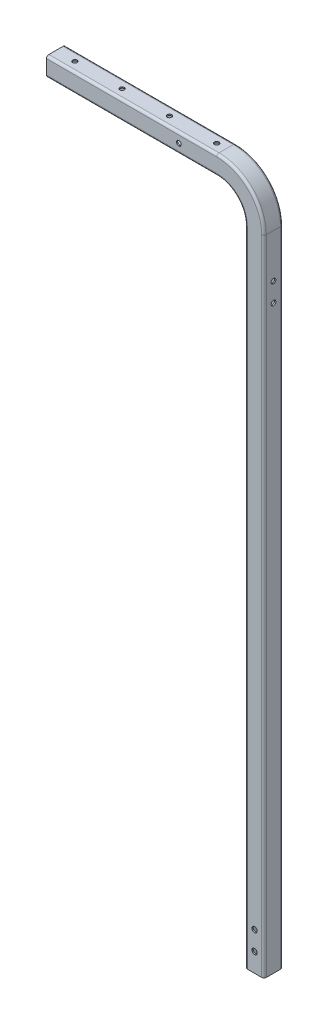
ISO-10303-21;
HEADER;
FILE_DESCRIPTION(('STEP AP214'),'2;1');
FILE_NAME('part.step','',(''),(''),'','','');
FILE_SCHEMA(('AUTOMOTIVE_DESIGN { 1 0 10303 214 1 1 1 1 }'));
ENDSEC;
DATA;
#1=APPLICATION_CONTEXT('core data for automotive mechanical design processes');
#2=APPLICATION_PROTOCOL_DEFINITION('international standard','automotive_design',2000,#1);
#3=PRODUCT_CONTEXT('',#1,'mechanical');
#4=PRODUCT('Part','Part','',(#3));
#5=PRODUCT_RELATED_PRODUCT_CATEGORY('part','',(#4));
#6=PRODUCT_DEFINITION_FORMATION('','',#4);
#7=PRODUCT_DEFINITION_CONTEXT('part definition',#1,'design');
#8=PRODUCT_DEFINITION('design','',#6,#7);
#9=PRODUCT_DEFINITION_SHAPE('','',#8);
#10=(LENGTH_UNIT() NAMED_UNIT(*) SI_UNIT(.MILLI.,.METRE.));
#11=(NAMED_UNIT(*) PLANE_ANGLE_UNIT() SI_UNIT($,.RADIAN.));
#12=(NAMED_UNIT(*) SI_UNIT($,.STERADIAN.) SOLID_ANGLE_UNIT());
#13=UNCERTAINTY_MEASURE_WITH_UNIT(LENGTH_MEASURE(1.E-05),#10,'distance_accuracy_value','');
#14=(GEOMETRIC_REPRESENTATION_CONTEXT(3) GLOBAL_UNCERTAINTY_ASSIGNED_CONTEXT((#13)) GLOBAL_UNIT_ASSIGNED_CONTEXT((#10,
#11,#12)) REPRESENTATION_CONTEXT('',''));
#15=CARTESIAN_POINT('',(0.,0.,0.));
#16=DIRECTION('',(0.,0.,1.));
#17=DIRECTION('',(1.,0.,0.));
#18=AXIS2_PLACEMENT_3D('',#15,#16,#17);
#19=CARTESIAN_POINT('',(25.4,12.7,0.));
#20=DIRECTION('',(0.,1.,0.));
#21=DIRECTION('',(0.,0.,1.));
#22=AXIS2_PLACEMENT_3D('',#19,#20,#21);
#23=CYLINDRICAL_SURFACE('',#22,2.99999999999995);
#24=CARTESIAN_POINT('',(25.4,-12.7,0.));
#25=DIRECTION('',(0.,-1.,0.));
#26=DIRECTION('',(0.,0.,-1.));
#27=AXIS2_PLACEMENT_3D('',#24,#25,#26);
#28=CIRCLE('',#27,2.99999999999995);
#29=CARTESIAN_POINT('',(25.4,-12.7,-2.99999999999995));
#30=VERTEX_POINT('',#29);
#31=EDGE_CURVE('E46',#30,#30,#28,.T.);
#32=ORIENTED_EDGE('',*,*,#31,.T.);
#33=EDGE_LOOP('',(#32));
#34=FACE_BOUND('',#33,.T.);
#35=CARTESIAN_POINT('',(25.4,-11.1125,0.));
#36=DIRECTION('',(0.,-1.,0.));
#37=DIRECTION('',(0.,0.,-1.));
#38=AXIS2_PLACEMENT_3D('',#35,#36,#37);
#39=CIRCLE('',#38,2.99999999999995);
#40=CARTESIAN_POINT('',(25.4,-11.1125,-2.99999999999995));
#41=VERTEX_POINT('',#40);
#42=EDGE_CURVE('E11',#41,#41,#39,.T.);
#43=ORIENTED_EDGE('',*,*,#42,.F.);
#44=EDGE_LOOP('',(#43));
#45=FACE_BOUND('',#44,.T.);
#46=ADVANCED_FACE('F38',(#34,#45),#23,.F.);
#47=CARTESIAN_POINT('',(88.9,12.7,0.));
#48=DIRECTION('',(0.,1.,0.));
#49=DIRECTION('',(0.,0.,1.));
#50=AXIS2_PLACEMENT_3D('',#47,#48,#49);
#51=CYLINDRICAL_SURFACE('',#50,2.99999999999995);
#52=CARTESIAN_POINT('',(88.9,-12.7,0.));
#53=DIRECTION('',(0.,-1.,0.));
#54=DIRECTION('',(0.,0.,-1.));
#55=AXIS2_PLACEMENT_3D('',#52,#53,#54);
#56=CIRCLE('',#55,2.99999999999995);
#57=CARTESIAN_POINT('',(88.9,-12.7,-2.99999999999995));
#58=VERTEX_POINT('',#57);
#59=EDGE_CURVE('E543',#58,#58,#56,.T.);
#60=ORIENTED_EDGE('',*,*,#59,.T.);
#61=EDGE_LOOP('',(#60));
#62=FACE_BOUND('',#61,.T.);
#63=CARTESIAN_POINT('',(88.9,-11.1125,0.));
#64=DIRECTION('',(0.,-1.,0.));
#65=DIRECTION('',(0.,0.,-1.));
#66=AXIS2_PLACEMENT_3D('',#63,#64,#65);
#67=CIRCLE('',#66,2.99999999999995);
#68=CARTESIAN_POINT('',(88.9,-11.1125,-2.99999999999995));
#69=VERTEX_POINT('',#68);
#70=EDGE_CURVE('E546',#69,#69,#67,.T.);
#71=ORIENTED_EDGE('',*,*,#70,.F.);
#72=EDGE_LOOP('',(#71));
#73=FACE_BOUND('',#72,.T.);
#74=ADVANCED_FACE('F739',(#62,#73),#51,.F.);
#75=CARTESIAN_POINT('',(25.4,12.7,0.));
#76=DIRECTION('',(0.,1.,0.));
#77=DIRECTION('',(0.,0.,1.));
#78=AXIS2_PLACEMENT_3D('',#75,#76,#77);
#79=CYLINDRICAL_SURFACE('',#78,2.99999999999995);
#80=CARTESIAN_POINT('',(25.4,12.7,0.));
#81=DIRECTION('',(0.,1.,0.));
#82=DIRECTION('',(0.,0.,1.));
#83=AXIS2_PLACEMENT_3D('',#80,#81,#82);
#84=CIRCLE('',#83,3.);
#85=CARTESIAN_POINT('',(25.4,12.7,3.));
#86=VERTEX_POINT('',#85);
#87=EDGE_CURVE('E537',#86,#86,#84,.T.);
#88=ORIENTED_EDGE('',*,*,#87,.T.);
#89=EDGE_LOOP('',(#88));
#90=FACE_BOUND('',#89,.T.);
#91=CARTESIAN_POINT('',(25.4,11.1125,0.));
#92=DIRECTION('',(0.,1.,0.));
#93=DIRECTION('',(0.,0.,1.));
#94=AXIS2_PLACEMENT_3D('',#91,#92,#93);
#95=CIRCLE('',#94,2.99999999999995);
#96=CARTESIAN_POINT('',(25.4,11.1125,2.99999999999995));
#97=VERTEX_POINT('',#96);
#98=EDGE_CURVE('E540',#97,#97,#95,.T.);
#99=ORIENTED_EDGE('',*,*,#98,.F.);
#100=EDGE_LOOP('',(#99));
#101=FACE_BOUND('',#100,.T.);
#102=ADVANCED_FACE('F744',(#90,#101),#79,.F.);
#103=CARTESIAN_POINT('',(88.9,12.7,0.));
#104=DIRECTION('',(0.,1.,0.));
#105=DIRECTION('',(0.,0.,1.));
#106=AXIS2_PLACEMENT_3D('',#103,#104,#105);
#107=CYLINDRICAL_SURFACE('',#106,2.99999999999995);
#108=CARTESIAN_POINT('',(88.9,12.7,0.));
#109=DIRECTION('',(0.,1.,0.));
#110=DIRECTION('',(0.,0.,1.));
#111=AXIS2_PLACEMENT_3D('',#108,#109,#110);
#112=CIRCLE('',#111,3.);
#113=CARTESIAN_POINT('',(88.9,12.7,3.));
#114=VERTEX_POINT('',#113);
#115=EDGE_CURVE('E501',#114,#114,#112,.T.);
#116=ORIENTED_EDGE('',*,*,#115,.T.);
#117=EDGE_LOOP('',(#116));
#118=FACE_BOUND('',#117,.T.);
#119=CARTESIAN_POINT('',(88.9,11.1125,0.));
#120=DIRECTION('',(0.,1.,0.));
#121=DIRECTION('',(0.,0.,1.));
#122=AXIS2_PLACEMENT_3D('',#119,#120,#121);
#123=CIRCLE('',#122,2.99999999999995);
#124=CARTESIAN_POINT('',(88.9,11.1125,2.99999999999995));
#125=VERTEX_POINT('',#124);
#126=EDGE_CURVE('E534',#125,#125,#123,.T.);
#127=ORIENTED_EDGE('',*,*,#126,.F.);
#128=EDGE_LOOP('',(#127));
#129=FACE_BOUND('',#128,.T.);
#130=ADVANCED_FACE('F800',(#118,#129),#107,.F.);
#131=CARTESIAN_POINT('',(292.1,-914.4,12.7));
#132=DIRECTION('',(0.,-1.,0.));
#133=DIRECTION('',(0.,0.,-1.));
#134=AXIS2_PLACEMENT_3D('',#131,#132,#133);
#135=PLANE('',#134);
#136=DIRECTION('',(0.,0.,-1.));
#137=VECTOR('',#136,1.);
#138=CARTESIAN_POINT('',(292.1,-914.4,12.7));
#139=LINE('',#138,#137);
#140=CARTESIAN_POINT('',(292.1,-914.4,9.525));
#141=VERTEX_POINT('',#140);
#142=CARTESIAN_POINT('',(292.1,-914.4,-9.52499999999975));
#143=VERTEX_POINT('',#142);
#144=EDGE_CURVE('E393',#141,#143,#139,.T.);
#145=ORIENTED_EDGE('',*,*,#144,.F.);
#146=CARTESIAN_POINT('',(288.925,-914.4,9.525));
#147=DIRECTION('',(0.,-1.,0.));
#148=DIRECTION('',(1.,0.,0.));
#149=AXIS2_PLACEMENT_3D('',#146,#147,#148);
#150=CIRCLE('',#149,3.175);
#151=CARTESIAN_POINT('',(288.925,-914.4,12.7));
#152=VERTEX_POINT('',#151);
#153=EDGE_CURVE('E421',#141,#152,#150,.T.);
#154=ORIENTED_EDGE('',*,*,#153,.T.);
#155=DIRECTION('',(-1.,0.,0.));
#156=VECTOR('',#155,1.);
#157=CARTESIAN_POINT('',(292.1,-914.4,12.7));
#158=LINE('',#157,#156);
#159=CARTESIAN_POINT('',(269.875,-914.4,12.7));
#160=VERTEX_POINT('',#159);
#161=EDGE_CURVE('E389',#152,#160,#158,.T.);
#162=ORIENTED_EDGE('',*,*,#161,.T.);
#163=CARTESIAN_POINT('',(269.875,-914.4,9.525));
#164=DIRECTION('',(0.,-1.,0.));
#165=DIRECTION('',(1.,0.,0.));
#166=AXIS2_PLACEMENT_3D('',#163,#164,#165);
#167=CIRCLE('',#166,3.175);
#168=CARTESIAN_POINT('',(266.7,-914.4,9.525));
#169=VERTEX_POINT('',#168);
#170=EDGE_CURVE('E412',#160,#169,#167,.T.);
#171=ORIENTED_EDGE('',*,*,#170,.T.);
#172=DIRECTION('',(0.,0.,1.));
#173=VECTOR('',#172,1.);
#174=CARTESIAN_POINT('',(266.7,-914.4,-12.7));
#175=LINE('',#174,#173);
#176=CARTESIAN_POINT('',(266.7,-914.4,-9.52499999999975));
#177=VERTEX_POINT('',#176);
#178=EDGE_CURVE('E401',#177,#169,#175,.T.);
#179=ORIENTED_EDGE('',*,*,#178,.F.);
#180=CARTESIAN_POINT('',(269.875,-914.4,-9.52499999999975));
#181=DIRECTION('',(0.,-1.,0.));
#182=DIRECTION('',(1.,0.,0.));
#183=AXIS2_PLACEMENT_3D('',#180,#181,#182);
#184=CIRCLE('',#183,3.175);
#185=CARTESIAN_POINT('',(269.875,-914.4,-12.7));
#186=VERTEX_POINT('',#185);
#187=EDGE_CURVE('E415',#177,#186,#184,.T.);
#188=ORIENTED_EDGE('',*,*,#187,.T.);
#189=DIRECTION('',(1.,0.,0.));
#190=VECTOR('',#189,1.);
#191=CARTESIAN_POINT('',(266.7,-914.4,-12.7));
#192=LINE('',#191,#190);
#193=CARTESIAN_POINT('',(288.925,-914.4,-12.7));
#194=VERTEX_POINT('',#193);
#195=EDGE_CURVE('E397',#186,#194,#192,.T.);
#196=ORIENTED_EDGE('',*,*,#195,.T.);
#197=CARTESIAN_POINT('',(288.925,-914.4,-9.52499999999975));
#198=DIRECTION('',(0.,-1.,0.));
#199=DIRECTION('',(1.,0.,0.));
#200=AXIS2_PLACEMENT_3D('',#197,#198,#199);
#201=CIRCLE('',#200,3.175);
#202=EDGE_CURVE('E418',#194,#143,#201,.T.);
#203=ORIENTED_EDGE('',*,*,#202,.T.);
#204=EDGE_LOOP('',(#145,#154,#162,#171,#179,#188,#196,#203));
#205=FACE_BOUND('',#204,.T.);
#206=CARTESIAN_POINT('',(288.925,-914.4,9.525));
#207=DIRECTION('',(0.,-1.,0.));
#208=DIRECTION('',(1.,0.,0.));
#209=AXIS2_PLACEMENT_3D('',#206,#207,#208);
#210=CIRCLE('',#209,1.5875);
#211=CARTESIAN_POINT('',(290.5125,-914.4,9.525));
#212=VERTEX_POINT('',#211);
#213=CARTESIAN_POINT('',(288.925,-914.4,11.1125));
#214=VERTEX_POINT('',#213);
#215=EDGE_CURVE('E320',#212,#214,#210,.T.);
#216=ORIENTED_EDGE('',*,*,#215,.F.);
#217=DIRECTION('',(0.,0.,-1.));
#218=VECTOR('',#217,1.);
#219=CARTESIAN_POINT('',(290.5125,-914.4,12.7));
#220=LINE('',#219,#218);
#221=CARTESIAN_POINT('',(290.5125,-914.4,-9.52499999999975));
#222=VERTEX_POINT('',#221);
#223=EDGE_CURVE('E317',#212,#222,#220,.T.);
#224=ORIENTED_EDGE('',*,*,#223,.T.);
#225=CARTESIAN_POINT('',(288.925,-914.4,-9.52499999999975));
#226=DIRECTION('',(0.,-1.,0.));
#227=DIRECTION('',(1.,0.,0.));
#228=AXIS2_PLACEMENT_3D('',#225,#226,#227);
#229=CIRCLE('',#228,1.5875);
#230=CARTESIAN_POINT('',(288.925,-914.4,-11.1124999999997));
#231=VERTEX_POINT('',#230);
#232=EDGE_CURVE('E314',#231,#222,#229,.T.);
#233=ORIENTED_EDGE('',*,*,#232,.F.);
#234=DIRECTION('',(1.,0.,0.));
#235=VECTOR('',#234,1.);
#236=CARTESIAN_POINT('',(228.6,-914.4,-11.1124999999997));
#237=LINE('',#236,#235);
#238=CARTESIAN_POINT('',(269.875,-914.4,-11.1124999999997));
#239=VERTEX_POINT('',#238);
#240=EDGE_CURVE('E54',#239,#231,#237,.T.);
#241=ORIENTED_EDGE('',*,*,#240,.F.);
#242=CARTESIAN_POINT('',(269.875,-914.4,-9.52499999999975));
#243=DIRECTION('',(0.,-1.,0.));
#244=DIRECTION('',(1.,0.,0.));
#245=AXIS2_PLACEMENT_3D('',#242,#243,#244);
#246=CIRCLE('',#245,1.5875);
#247=CARTESIAN_POINT('',(268.2875,-914.4,-9.52499999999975));
#248=VERTEX_POINT('',#247);
#249=EDGE_CURVE('E311',#248,#239,#246,.T.);
#250=ORIENTED_EDGE('',*,*,#249,.F.);
#251=DIRECTION('',(0.,0.,1.));
#252=VECTOR('',#251,1.);
#253=CARTESIAN_POINT('',(268.2875,-914.4,12.7));
#254=LINE('',#253,#252);
#255=CARTESIAN_POINT('',(268.2875,-914.4,9.525));
#256=VERTEX_POINT('',#255);
#257=EDGE_CURVE('E307',#248,#256,#254,.T.);
#258=ORIENTED_EDGE('',*,*,#257,.T.);
#259=CARTESIAN_POINT('',(269.875,-914.4,9.525));
#260=DIRECTION('',(0.,-1.,0.));
#261=DIRECTION('',(1.,0.,0.));
#262=AXIS2_PLACEMENT_3D('',#259,#260,#261);
#263=CIRCLE('',#262,1.5875);
#264=CARTESIAN_POINT('',(269.875,-914.4,11.1125));
#265=VERTEX_POINT('',#264);
#266=EDGE_CURVE('E259',#265,#256,#263,.T.);
#267=ORIENTED_EDGE('',*,*,#266,.F.);
#268=DIRECTION('',(-1.,0.,0.));
#269=VECTOR('',#268,1.);
#270=CARTESIAN_POINT('',(228.6,-914.4,11.1125));
#271=LINE('',#270,#269);
#272=EDGE_CURVE('E276',#214,#265,#271,.T.);
#273=ORIENTED_EDGE('',*,*,#272,.F.);
#274=EDGE_LOOP('',(#216,#224,#233,#241,#250,#258,#267,#273));
#275=FACE_BOUND('',#274,.T.);
#276=ADVANCED_FACE('F709',(#205,#275),#135,.T.);
#277=CARTESIAN_POINT('',(266.7,-50.8,-12.7));
#278=DIRECTION('',(1.,0.,0.));
#279=DIRECTION('',(0.,1.,0.));
#280=AXIS2_PLACEMENT_3D('',#277,#278,#279);
#281=PLANE('',#280);
#282=CARTESIAN_POINT('',(266.7,-134.9375,0.));
#283=DIRECTION('',(1.,0.,0.));
#284=DIRECTION('',(0.,1.,0.));
#285=AXIS2_PLACEMENT_3D('',#282,#283,#284);
#286=CIRCLE('',#285,3.17499999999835);
#287=CARTESIAN_POINT('',(266.7,-131.762500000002,0.));
#288=VERTEX_POINT('',#287);
#289=EDGE_CURVE('E562',#288,#288,#286,.T.);
#290=ORIENTED_EDGE('',*,*,#289,.T.);
#291=EDGE_LOOP('',(#290));
#292=FACE_BOUND('',#291,.T.);
#293=CARTESIAN_POINT('',(266.7,-109.5375,0.));
#294=DIRECTION('',(1.,0.,0.));
#295=DIRECTION('',(0.,1.,0.));
#296=AXIS2_PLACEMENT_3D('',#293,#294,#295);
#297=CIRCLE('',#296,3.17499999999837);
#298=CARTESIAN_POINT('',(266.7,-106.362500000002,0.));
#299=VERTEX_POINT('',#298);
#300=EDGE_CURVE('E580',#299,#299,#297,.T.);
#301=ORIENTED_EDGE('',*,*,#300,.T.);
#302=EDGE_LOOP('',(#301));
#303=FACE_BOUND('',#302,.T.);
#304=DIRECTION('',(0.,0.,1.));
#305=VECTOR('',#304,1.);
#306=CARTESIAN_POINT('',(266.7,-50.8,-12.7));
#307=LINE('',#306,#305);
#308=CARTESIAN_POINT('',(266.7,-50.8,-9.52499999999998));
#309=VERTEX_POINT('',#308);
#310=CARTESIAN_POINT('',(266.7,-50.8,9.525));
#311=VERTEX_POINT('',#310);
#312=EDGE_CURVE('E385',#309,#311,#307,.T.);
#313=ORIENTED_EDGE('',*,*,#312,.F.);
#314=DIRECTION('',(0.,-1.,0.));
#315=VECTOR('',#314,1.);
#316=CARTESIAN_POINT('',(266.7,-50.8,-9.52499999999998));
#317=LINE('',#316,#315);
#318=EDGE_CURVE('E465',#309,#177,#317,.T.);
#319=ORIENTED_EDGE('',*,*,#318,.T.);
#320=ORIENTED_EDGE('',*,*,#178,.T.);
#321=DIRECTION('',(0.,-1.,0.));
#322=VECTOR('',#321,1.);
#323=CARTESIAN_POINT('',(266.7,-50.8,9.525));
#324=LINE('',#323,#322);
#325=EDGE_CURVE('E462',#169,#311,#324,.F.);
#326=ORIENTED_EDGE('',*,*,#325,.T.);
#327=EDGE_LOOP('',(#313,#319,#320,#326));
#328=FACE_BOUND('',#327,.T.);
#329=ADVANCED_FACE('F799',(#292,#303,#328),#281,.F.);
#330=CARTESIAN_POINT('',(292.1,-50.8,12.7));
#331=DIRECTION('',(-1.,0.,0.));
#332=DIRECTION('',(0.,-1.,0.));
#333=AXIS2_PLACEMENT_3D('',#330,#331,#332);
#334=PLANE('',#333);
#335=CARTESIAN_POINT('',(292.1,-134.9375,0.));
#336=DIRECTION('',(1.,0.,0.));
#337=DIRECTION('',(0.,1.,0.));
#338=AXIS2_PLACEMENT_3D('',#335,#336,#337);
#339=CIRCLE('',#338,3.17499999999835);
#340=CARTESIAN_POINT('',(292.1,-131.762500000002,0.));
#341=VERTEX_POINT('',#340);
#342=EDGE_CURVE('E558',#341,#341,#339,.T.);
#343=ORIENTED_EDGE('',*,*,#342,.F.);
#344=EDGE_LOOP('',(#343));
#345=FACE_BOUND('',#344,.T.);
#346=CARTESIAN_POINT('',(292.1,-109.5375,0.));
#347=DIRECTION('',(1.,0.,0.));
#348=DIRECTION('',(0.,1.,0.));
#349=AXIS2_PLACEMENT_3D('',#346,#347,#348);
#350=CIRCLE('',#349,3.17499999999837);
#351=CARTESIAN_POINT('',(292.1,-106.362500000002,0.));
#352=VERTEX_POINT('',#351);
#353=EDGE_CURVE('E554',#352,#352,#350,.T.);
#354=ORIENTED_EDGE('',*,*,#353,.F.);
#355=EDGE_LOOP('',(#354));
#356=FACE_BOUND('',#355,.T.);
#357=DIRECTION('',(0.,0.,-1.));
#358=VECTOR('',#357,1.);
#359=CARTESIAN_POINT('',(292.1,-50.8,12.7));
#360=LINE('',#359,#358);
#361=CARTESIAN_POINT('',(292.1,-50.8,9.525));
#362=VERTEX_POINT('',#361);
#363=CARTESIAN_POINT('',(292.1,-50.8,-9.52499999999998));
#364=VERTEX_POINT('',#363);
#365=EDGE_CURVE('E365',#362,#364,#360,.T.);
#366=ORIENTED_EDGE('',*,*,#365,.F.);
#367=DIRECTION('',(0.,-1.,0.));
#368=VECTOR('',#367,1.);
#369=CARTESIAN_POINT('',(292.1,-50.8,9.525));
#370=LINE('',#369,#368);
#371=EDGE_CURVE('E408',#362,#141,#370,.T.);
#372=ORIENTED_EDGE('',*,*,#371,.T.);
#373=ORIENTED_EDGE('',*,*,#144,.T.);
#374=DIRECTION('',(0.,-1.,0.));
#375=VECTOR('',#374,1.);
#376=CARTESIAN_POINT('',(292.1,-50.8,-9.52499999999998));
#377=LINE('',#376,#375);
#378=EDGE_CURVE('E405',#143,#364,#377,.F.);
#379=ORIENTED_EDGE('',*,*,#378,.T.);
#380=EDGE_LOOP('',(#366,#372,#373,#379));
#381=FACE_BOUND('',#380,.T.);
#382=ADVANCED_FACE('F828',(#345,#356,#381),#334,.F.);
#383=CARTESIAN_POINT('',(228.6,-50.8,0.));
#384=DIRECTION('',(0.,0.,-1.));
#385=DIRECTION('',(-1.,0.,0.));
#386=AXIS2_PLACEMENT_3D('',#383,#384,#385);
#387=CYLINDRICAL_SURFACE('',#386,38.1);
#388=DIRECTION('',(0.,0.,1.));
#389=VECTOR('',#388,1.);
#390=CARTESIAN_POINT('',(228.6,-12.7,-12.7));
#391=LINE('',#390,#389);
#392=CARTESIAN_POINT('',(228.6,-12.7,-9.525));
#393=VERTEX_POINT('',#392);
#394=CARTESIAN_POINT('',(228.6,-12.7,9.525));
#395=VERTEX_POINT('',#394);
#396=EDGE_CURVE('E356',#393,#395,#391,.T.);
#397=ORIENTED_EDGE('',*,*,#396,.F.);
#398=CARTESIAN_POINT('',(228.6,-50.8,-9.52499999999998));
#399=DIRECTION('',(0.,0.,1.));
#400=DIRECTION('',(0.,-1.,0.));
#401=AXIS2_PLACEMENT_3D('',#398,#399,#400);
#402=CIRCLE('',#401,38.1);
#403=EDGE_CURVE('E478',#393,#309,#402,.F.);
#404=ORIENTED_EDGE('',*,*,#403,.T.);
#405=ORIENTED_EDGE('',*,*,#312,.T.);
#406=CARTESIAN_POINT('',(228.6,-50.8,9.525));
#407=DIRECTION('',(0.,0.,-1.));
#408=DIRECTION('',(-1.,0.,0.));
#409=AXIS2_PLACEMENT_3D('',#406,#407,#408);
#410=CIRCLE('',#409,38.1);
#411=EDGE_CURVE('E475',#311,#395,#410,.F.);
#412=ORIENTED_EDGE('',*,*,#411,.T.);
#413=EDGE_LOOP('',(#397,#404,#405,#412));
#414=FACE_BOUND('',#413,.T.);
#415=ADVANCED_FACE('F824',(#414),#387,.F.);
#416=CARTESIAN_POINT('',(228.6,-50.8,0.));
#417=DIRECTION('',(0.,0.,-1.));
#418=DIRECTION('',(-1.,0.,0.));
#419=AXIS2_PLACEMENT_3D('',#416,#417,#418);
#420=CYLINDRICAL_SURFACE('',#419,63.5);
#421=DIRECTION('',(0.,0.,-1.));
#422=VECTOR('',#421,1.);
#423=CARTESIAN_POINT('',(228.6,12.7,12.7));
#424=LINE('',#423,#422);
#425=CARTESIAN_POINT('',(228.6,12.7,9.525));
#426=VERTEX_POINT('',#425);
#427=CARTESIAN_POINT('',(228.6,12.7,-9.525));
#428=VERTEX_POINT('',#427);
#429=EDGE_CURVE('E360',#426,#428,#424,.T.);
#430=ORIENTED_EDGE('',*,*,#429,.F.);
#431=CARTESIAN_POINT('',(228.6,-50.8,9.525));
#432=DIRECTION('',(0.,0.,-1.));
#433=DIRECTION('',(-1.,0.,0.));
#434=AXIS2_PLACEMENT_3D('',#431,#432,#433);
#435=CIRCLE('',#434,63.5);
#436=EDGE_CURVE('E472',#426,#362,#435,.T.);
#437=ORIENTED_EDGE('',*,*,#436,.T.);
#438=ORIENTED_EDGE('',*,*,#365,.T.);
#439=CARTESIAN_POINT('',(228.6,-50.8,-9.52499999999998));
#440=DIRECTION('',(0.,0.,1.));
#441=DIRECTION('',(0.,-1.,0.));
#442=AXIS2_PLACEMENT_3D('',#439,#440,#441);
#443=CIRCLE('',#442,63.5);
#444=EDGE_CURVE('E469',#364,#428,#443,.T.);
#445=ORIENTED_EDGE('',*,*,#444,.T.);
#446=EDGE_LOOP('',(#430,#437,#438,#445));
#447=FACE_BOUND('',#446,.T.);
#448=ADVANCED_FACE('F820',(#447),#420,.T.);
#449=CARTESIAN_POINT('',(228.6,12.7,12.7));
#450=DIRECTION('',(0.,0.,-1.));
#451=DIRECTION('',(-1.,0.,0.));
#452=AXIS2_PLACEMENT_3D('',#449,#450,#451);
#453=PLANE('',#452);
#454=CARTESIAN_POINT('',(279.4,-863.6,12.7000000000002));
#455=DIRECTION('',(0.,0.,-1.));
#456=DIRECTION('',(0.,1.,0.));
#457=AXIS2_PLACEMENT_3D('',#454,#455,#456);
#458=CIRCLE('',#457,3.57187499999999);
#459=CARTESIAN_POINT('',(279.4,-860.028125,12.7000000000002));
#460=VERTEX_POINT('',#459);
#461=EDGE_CURVE('E1452',#460,#460,#458,.T.);
#462=ORIENTED_EDGE('',*,*,#461,.T.);
#463=EDGE_LOOP('',(#462));
#464=FACE_BOUND('',#463,.T.);
#465=CARTESIAN_POINT('',(279.4,-889.,12.7000000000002));
#466=DIRECTION('',(0.,0.,-1.));
#467=DIRECTION('',(0.,1.,0.));
#468=AXIS2_PLACEMENT_3D('',#465,#466,#467);
#469=CIRCLE('',#468,3.57187499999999);
#470=CARTESIAN_POINT('',(279.4,-885.428125,12.7000000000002));
#471=VERTEX_POINT('',#470);
#472=EDGE_CURVE('E1446',#471,#471,#469,.T.);
#473=ORIENTED_EDGE('',*,*,#472,.T.);
#474=EDGE_LOOP('',(#473));
#475=FACE_BOUND('',#474,.T.);
#476=CARTESIAN_POINT('',(177.8,0.,12.7));
#477=DIRECTION('',(0.,0.,1.));
#478=DIRECTION('',(1.,0.,0.));
#479=AXIS2_PLACEMENT_3D('',#476,#477,#478);
#480=CIRCLE('',#479,3.17499999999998);
#481=CARTESIAN_POINT('',(180.975,0.,12.7));
#482=VERTEX_POINT('',#481);
#483=EDGE_CURVE('E1461',#482,#482,#480,.T.);
#484=ORIENTED_EDGE('',*,*,#483,.F.);
#485=EDGE_LOOP('',(#484));
#486=FACE_BOUND('',#485,.T.);
#487=ORIENTED_EDGE('',*,*,#161,.F.);
#488=DIRECTION('',(0.,-1.,0.));
#489=VECTOR('',#488,1.);
#490=CARTESIAN_POINT('',(288.925,12.7,12.7));
#491=LINE('',#490,#489);
#492=CARTESIAN_POINT('',(288.925,-50.8,12.7));
#493=VERTEX_POINT('',#492);
#494=EDGE_CURVE('E440',#152,#493,#491,.F.);
#495=ORIENTED_EDGE('',*,*,#494,.T.);
#496=CARTESIAN_POINT('',(228.6,-50.8,12.7));
#497=DIRECTION('',(0.,0.,-1.));
#498=DIRECTION('',(-1.,0.,0.));
#499=AXIS2_PLACEMENT_3D('',#496,#497,#498);
#500=CIRCLE('',#499,60.325);
#501=CARTESIAN_POINT('',(228.6,9.52500000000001,12.7));
#502=VERTEX_POINT('',#501);
#503=EDGE_CURVE('E437',#493,#502,#500,.F.);
#504=ORIENTED_EDGE('',*,*,#503,.T.);
#505=DIRECTION('',(-1.,0.,0.));
#506=VECTOR('',#505,1.);
#507=CARTESIAN_POINT('',(0.,9.52500000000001,12.7));
#508=LINE('',#507,#506);
#509=CARTESIAN_POINT('',(0.,9.52500000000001,12.7));
#510=VERTEX_POINT('',#509);
#511=EDGE_CURVE('E434',#502,#510,#508,.T.);
#512=ORIENTED_EDGE('',*,*,#511,.T.);
#513=DIRECTION('',(0.,-1.,0.));
#514=VECTOR('',#513,1.);
#515=CARTESIAN_POINT('',(0.,12.7,12.7));
#516=LINE('',#515,#514);
#517=CARTESIAN_POINT('',(0.,-9.52499999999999,12.7));
#518=VERTEX_POINT('',#517);
#519=EDGE_CURVE('E366',#510,#518,#516,.T.);
#520=ORIENTED_EDGE('',*,*,#519,.T.);
#521=DIRECTION('',(-1.,0.,0.));
#522=VECTOR('',#521,1.);
#523=CARTESIAN_POINT('',(228.6,-9.52499999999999,12.7));
#524=LINE('',#523,#522);
#525=CARTESIAN_POINT('',(228.6,-9.52499999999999,12.7));
#526=VERTEX_POINT('',#525);
#527=EDGE_CURVE('E424',#518,#526,#524,.F.);
#528=ORIENTED_EDGE('',*,*,#527,.T.);
#529=CARTESIAN_POINT('',(228.6,-50.8,12.7));
#530=DIRECTION('',(0.,0.,-1.));
#531=DIRECTION('',(-1.,0.,0.));
#532=AXIS2_PLACEMENT_3D('',#529,#530,#531);
#533=CIRCLE('',#532,41.275);
#534=CARTESIAN_POINT('',(269.875,-50.8,12.7));
#535=VERTEX_POINT('',#534);
#536=EDGE_CURVE('E427',#526,#535,#533,.T.);
#537=ORIENTED_EDGE('',*,*,#536,.T.);
#538=DIRECTION('',(0.,-1.,0.));
#539=VECTOR('',#538,1.);
#540=CARTESIAN_POINT('',(269.875,12.7,12.7));
#541=LINE('',#540,#539);
#542=EDGE_CURVE('E430',#535,#160,#541,.T.);
#543=ORIENTED_EDGE('',*,*,#542,.T.);
#544=EDGE_LOOP('',(#487,#495,#504,#512,#520,#528,#537,#543));
#545=FACE_BOUND('',#544,.T.);
#546=ADVANCED_FACE('F816',(#464,#475,#486,#545),#453,.F.);
#547=CARTESIAN_POINT('',(228.6,-12.7,-12.7));
#548=DIRECTION('',(0.,-1.,0.));
#549=DIRECTION('',(0.,0.,-1.));
#550=AXIS2_PLACEMENT_3D('',#547,#548,#549);
#551=PLANE('',#550);
#552=CARTESIAN_POINT('',(152.4,-12.7,0.));
#553=DIRECTION('',(0.,-1.,0.));
#554=DIRECTION('',(0.,0.,-1.));
#555=AXIS2_PLACEMENT_3D('',#552,#553,#554);
#556=CIRCLE('',#555,2.99999999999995);
#557=CARTESIAN_POINT('',(152.4,-12.7,-2.99999999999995));
#558=VERTEX_POINT('',#557);
#559=EDGE_CURVE('E583',#558,#558,#556,.T.);
#560=ORIENTED_EDGE('',*,*,#559,.F.);
#561=EDGE_LOOP('',(#560));
#562=FACE_BOUND('',#561,.T.);
#563=CARTESIAN_POINT('',(215.9,-12.7,0.));
#564=DIRECTION('',(0.,-1.,0.));
#565=DIRECTION('',(0.,0.,-1.));
#566=AXIS2_PLACEMENT_3D('',#563,#564,#565);
#567=CIRCLE('',#566,2.99999999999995);
#568=CARTESIAN_POINT('',(215.9,-12.7,-2.99999999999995));
#569=VERTEX_POINT('',#568);
#570=EDGE_CURVE('E300',#569,#569,#567,.T.);
#571=ORIENTED_EDGE('',*,*,#570,.F.);
#572=EDGE_LOOP('',(#571));
#573=FACE_BOUND('',#572,.T.);
#574=DIRECTION('',(0.,0.,1.));
#575=VECTOR('',#574,1.);
#576=CARTESIAN_POINT('',(0.,-12.7,-12.7));
#577=LINE('',#576,#575);
#578=CARTESIAN_POINT('',(0.,-12.7,-9.525));
#579=VERTEX_POINT('',#578);
#580=CARTESIAN_POINT('',(0.,-12.7,9.525));
#581=VERTEX_POINT('',#580);
#582=EDGE_CURVE('E370',#579,#581,#577,.T.);
#583=ORIENTED_EDGE('',*,*,#582,.F.);
#584=DIRECTION('',(-1.,0.,0.));
#585=VECTOR('',#584,1.);
#586=CARTESIAN_POINT('',(228.6,-12.7,-9.525));
#587=LINE('',#586,#585);
#588=EDGE_CURVE('E498',#579,#393,#587,.F.);
#589=ORIENTED_EDGE('',*,*,#588,.T.);
#590=ORIENTED_EDGE('',*,*,#396,.T.);
#591=DIRECTION('',(-1.,0.,0.));
#592=VECTOR('',#591,1.);
#593=CARTESIAN_POINT('',(0.,-12.7,9.525));
#594=LINE('',#593,#592);
#595=EDGE_CURVE('E495',#395,#581,#594,.T.);
#596=ORIENTED_EDGE('',*,*,#595,.T.);
#597=EDGE_LOOP('',(#583,#589,#590,#596));
#598=FACE_BOUND('',#597,.T.);
#599=ORIENTED_EDGE('',*,*,#59,.F.);
#600=EDGE_LOOP('',(#599));
#601=FACE_BOUND('',#600,.T.);
#602=ORIENTED_EDGE('',*,*,#31,.F.);
#603=EDGE_LOOP('',(#602));
#604=FACE_BOUND('',#603,.T.);
#605=ADVANCED_FACE('F812',(#562,#573,#598,#601,#604),#551,.T.);
#606=CARTESIAN_POINT('',(228.6,-12.7,-12.7));
#607=DIRECTION('',(0.,0.,1.));
#608=DIRECTION('',(0.,-1.,0.));
#609=AXIS2_PLACEMENT_3D('',#606,#607,#608);
#610=PLANE('',#609);
#611=CARTESIAN_POINT('',(279.4,-863.6,-12.6999999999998));
#612=DIRECTION('',(0.,0.,-1.));
#613=DIRECTION('',(0.,1.,0.));
#614=AXIS2_PLACEMENT_3D('',#611,#612,#613);
#615=CIRCLE('',#614,3.57187499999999);
#616=CARTESIAN_POINT('',(279.4,-860.028125,-12.6999999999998));
#617=VERTEX_POINT('',#616);
#618=EDGE_CURVE('E1476',#617,#617,#615,.T.);
#619=ORIENTED_EDGE('',*,*,#618,.F.);
#620=EDGE_LOOP('',(#619));
#621=FACE_BOUND('',#620,.T.);
#622=CARTESIAN_POINT('',(279.4,-889.,-12.6999999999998));
#623=DIRECTION('',(0.,0.,-1.));
#624=DIRECTION('',(0.,1.,0.));
#625=AXIS2_PLACEMENT_3D('',#622,#623,#624);
#626=CIRCLE('',#625,3.57187499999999);
#627=CARTESIAN_POINT('',(279.4,-885.428125,-12.6999999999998));
#628=VERTEX_POINT('',#627);
#629=EDGE_CURVE('E1448',#628,#628,#626,.T.);
#630=ORIENTED_EDGE('',*,*,#629,.F.);
#631=EDGE_LOOP('',(#630));
#632=FACE_BOUND('',#631,.T.);
#633=CARTESIAN_POINT('',(177.8,0.,-12.7));
#634=DIRECTION('',(0.,0.,1.));
#635=DIRECTION('',(1.,0.,0.));
#636=AXIS2_PLACEMENT_3D('',#633,#634,#635);
#637=CIRCLE('',#636,3.17499999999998);
#638=CARTESIAN_POINT('',(180.975,0.,-12.7));
#639=VERTEX_POINT('',#638);
#640=EDGE_CURVE('E1458',#639,#639,#637,.T.);
#641=ORIENTED_EDGE('',*,*,#640,.T.);
#642=EDGE_LOOP('',(#641));
#643=FACE_BOUND('',#642,.T.);
#644=CARTESIAN_POINT('',(228.6,-50.8,-12.7));
#645=DIRECTION('',(0.,0.,1.));
#646=DIRECTION('',(0.,-1.,0.));
#647=AXIS2_PLACEMENT_3D('',#644,#645,#646);
#648=CIRCLE('',#647,60.325);
#649=CARTESIAN_POINT('',(228.6,9.52500000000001,-12.7));
#650=VERTEX_POINT('',#649);
#651=CARTESIAN_POINT('',(288.925,-50.8,-12.7));
#652=VERTEX_POINT('',#651);
#653=EDGE_CURVE('E455',#650,#652,#648,.F.);
#654=ORIENTED_EDGE('',*,*,#653,.T.);
#655=DIRECTION('',(0.,-1.,0.));
#656=VECTOR('',#655,1.);
#657=CARTESIAN_POINT('',(288.925,-12.7,-12.7));
#658=LINE('',#657,#656);
#659=EDGE_CURVE('E458',#652,#194,#658,.T.);
#660=ORIENTED_EDGE('',*,*,#659,.T.);
#661=ORIENTED_EDGE('',*,*,#195,.F.);
#662=DIRECTION('',(0.,-1.,0.));
#663=VECTOR('',#662,1.);
#664=CARTESIAN_POINT('',(269.875,-12.7,-12.7));
#665=LINE('',#664,#663);
#666=CARTESIAN_POINT('',(269.875,-50.8,-12.7));
#667=VERTEX_POINT('',#666);
#668=EDGE_CURVE('E449',#186,#667,#665,.F.);
#669=ORIENTED_EDGE('',*,*,#668,.T.);
#670=CARTESIAN_POINT('',(228.6,-50.8,-12.7));
#671=DIRECTION('',(0.,0.,1.));
#672=DIRECTION('',(0.,-1.,0.));
#673=AXIS2_PLACEMENT_3D('',#670,#671,#672);
#674=CIRCLE('',#673,41.275);
#675=CARTESIAN_POINT('',(228.6,-9.525,-12.7));
#676=VERTEX_POINT('',#675);
#677=EDGE_CURVE('E446',#667,#676,#674,.T.);
#678=ORIENTED_EDGE('',*,*,#677,.T.);
#679=DIRECTION('',(-1.,0.,0.));
#680=VECTOR('',#679,1.);
#681=CARTESIAN_POINT('',(0.,-9.525,-12.7));
#682=LINE('',#681,#680);
#683=CARTESIAN_POINT('',(0.,-9.525,-12.7));
#684=VERTEX_POINT('',#683);
#685=EDGE_CURVE('E443',#676,#684,#682,.T.);
#686=ORIENTED_EDGE('',*,*,#685,.T.);
#687=DIRECTION('',(0.,1.,0.));
#688=VECTOR('',#687,1.);
#689=CARTESIAN_POINT('',(0.,-12.7,-12.7));
#690=LINE('',#689,#688);
#691=CARTESIAN_POINT('',(0.,9.52500000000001,-12.7));
#692=VERTEX_POINT('',#691);
#693=EDGE_CURVE('E375',#684,#692,#690,.T.);
#694=ORIENTED_EDGE('',*,*,#693,.T.);
#695=DIRECTION('',(-1.,0.,0.));
#696=VECTOR('',#695,1.);
#697=CARTESIAN_POINT('',(228.6,9.52500000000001,-12.7));
#698=LINE('',#697,#696);
#699=EDGE_CURVE('E452',#692,#650,#698,.F.);
#700=ORIENTED_EDGE('',*,*,#699,.T.);
#701=EDGE_LOOP('',(#654,#660,#661,#669,#678,#686,#694,#700));
#702=FACE_BOUND('',#701,.T.);
#703=ADVANCED_FACE('F808',(#621,#632,#643,#702),#610,.F.);
#704=CARTESIAN_POINT('',(228.6,12.7,12.7));
#705=DIRECTION('',(0.,1.,0.));
#706=DIRECTION('',(0.,0.,1.));
#707=AXIS2_PLACEMENT_3D('',#704,#705,#706);
#708=PLANE('',#707);
#709=CARTESIAN_POINT('',(152.4,12.7,0.));
#710=DIRECTION('',(0.,1.,0.));
#711=DIRECTION('',(0.,0.,1.));
#712=AXIS2_PLACEMENT_3D('',#709,#710,#711);
#713=CIRCLE('',#712,3.);
#714=CARTESIAN_POINT('',(152.4,12.7,3.));
#715=VERTEX_POINT('',#714);
#716=EDGE_CURVE('E589',#715,#715,#713,.T.);
#717=ORIENTED_EDGE('',*,*,#716,.F.);
#718=EDGE_LOOP('',(#717));
#719=FACE_BOUND('',#718,.T.);
#720=CARTESIAN_POINT('',(215.9,12.7,0.));
#721=DIRECTION('',(0.,1.,0.));
#722=DIRECTION('',(0.,0.,1.));
#723=AXIS2_PLACEMENT_3D('',#720,#721,#722);
#724=CIRCLE('',#723,3.);
#725=CARTESIAN_POINT('',(215.9,12.7,3.));
#726=VERTEX_POINT('',#725);
#727=EDGE_CURVE('E531',#726,#726,#724,.T.);
#728=ORIENTED_EDGE('',*,*,#727,.F.);
#729=EDGE_LOOP('',(#728));
#730=FACE_BOUND('',#729,.T.);
#731=DIRECTION('',(0.,0.,-1.));
#732=VECTOR('',#731,1.);
#733=CARTESIAN_POINT('',(0.,12.7,12.7));
#734=LINE('',#733,#732);
#735=CARTESIAN_POINT('',(0.,12.7,9.525));
#736=VERTEX_POINT('',#735);
#737=CARTESIAN_POINT('',(0.,12.7,-9.525));
#738=VERTEX_POINT('',#737);
#739=EDGE_CURVE('E361',#736,#738,#734,.T.);
#740=ORIENTED_EDGE('',*,*,#739,.F.);
#741=DIRECTION('',(-1.,0.,0.));
#742=VECTOR('',#741,1.);
#743=CARTESIAN_POINT('',(228.6,12.7,9.525));
#744=LINE('',#743,#742);
#745=EDGE_CURVE('E492',#736,#426,#744,.F.);
#746=ORIENTED_EDGE('',*,*,#745,.T.);
#747=ORIENTED_EDGE('',*,*,#429,.T.);
#748=DIRECTION('',(-1.,0.,0.));
#749=VECTOR('',#748,1.);
#750=CARTESIAN_POINT('',(0.,12.7,-9.525));
#751=LINE('',#750,#749);
#752=EDGE_CURVE('E489',#428,#738,#751,.T.);
#753=ORIENTED_EDGE('',*,*,#752,.T.);
#754=EDGE_LOOP('',(#740,#746,#747,#753));
#755=FACE_BOUND('',#754,.T.);
#756=ORIENTED_EDGE('',*,*,#115,.F.);
#757=EDGE_LOOP('',(#756));
#758=FACE_BOUND('',#757,.T.);
#759=ORIENTED_EDGE('',*,*,#87,.F.);
#760=EDGE_LOOP('',(#759));
#761=FACE_BOUND('',#760,.T.);
#762=ADVANCED_FACE('F805',(#719,#730,#755,#758,#761),#708,.T.);
#763=CARTESIAN_POINT('',(0.,12.7,12.7));
#764=DIRECTION('',(1.,0.,0.));
#765=DIRECTION('',(0.,0.,-1.));
#766=AXIS2_PLACEMENT_3D('',#763,#764,#765);
#767=PLANE('',#766);
#768=CARTESIAN_POINT('',(0.,9.52500000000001,9.525));
#769=DIRECTION('',(1.,0.,0.));
#770=DIRECTION('',(0.,0.,-1.));
#771=AXIS2_PLACEMENT_3D('',#768,#769,#770);
#772=CIRCLE('',#771,1.5875);
#773=CARTESIAN_POINT('',(0.,9.52500000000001,11.1125));
#774=VERTEX_POINT('',#773);
#775=CARTESIAN_POINT('',(0.,11.1125,9.525));
#776=VERTEX_POINT('',#775);
#777=EDGE_CURVE('E343',#774,#776,#772,.F.);
#778=ORIENTED_EDGE('',*,*,#777,.F.);
#779=DIRECTION('',(0.,-1.,0.));
#780=VECTOR('',#779,1.);
#781=CARTESIAN_POINT('',(0.,12.7,11.1125));
#782=LINE('',#781,#780);
#783=CARTESIAN_POINT('',(0.,-9.52499999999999,11.1125));
#784=VERTEX_POINT('',#783);
#785=EDGE_CURVE('E335',#774,#784,#782,.T.);
#786=ORIENTED_EDGE('',*,*,#785,.T.);
#787=CARTESIAN_POINT('',(0.,-9.52499999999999,9.525));
#788=DIRECTION('',(1.,0.,0.));
#789=DIRECTION('',(0.,0.,-1.));
#790=AXIS2_PLACEMENT_3D('',#787,#788,#789);
#791=CIRCLE('',#790,1.5875);
#792=CARTESIAN_POINT('',(0.,-11.1125,9.525));
#793=VERTEX_POINT('',#792);
#794=EDGE_CURVE('E336',#793,#784,#791,.F.);
#795=ORIENTED_EDGE('',*,*,#794,.F.);
#796=DIRECTION('',(0.,0.,1.));
#797=VECTOR('',#796,1.);
#798=CARTESIAN_POINT('',(0.,-11.1125,-12.7));
#799=LINE('',#798,#797);
#800=CARTESIAN_POINT('',(0.,-11.1125,-9.525));
#801=VERTEX_POINT('',#800);
#802=EDGE_CURVE('E62',#801,#793,#799,.T.);
#803=ORIENTED_EDGE('',*,*,#802,.F.);
#804=CARTESIAN_POINT('',(0.,-9.525,-9.525));
#805=DIRECTION('',(1.,0.,0.));
#806=DIRECTION('',(0.,0.,-1.));
#807=AXIS2_PLACEMENT_3D('',#804,#805,#806);
#808=CIRCLE('',#807,1.5875);
#809=CARTESIAN_POINT('',(0.,-9.525,-11.1125));
#810=VERTEX_POINT('',#809);
#811=EDGE_CURVE('E338',#810,#801,#808,.F.);
#812=ORIENTED_EDGE('',*,*,#811,.F.);
#813=DIRECTION('',(0.,1.,0.));
#814=VECTOR('',#813,1.);
#815=CARTESIAN_POINT('',(0.,-12.7,-11.1125));
#816=LINE('',#815,#814);
#817=CARTESIAN_POINT('',(0.,9.52500000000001,-11.1125));
#818=VERTEX_POINT('',#817);
#819=EDGE_CURVE('E334',#810,#818,#816,.T.);
#820=ORIENTED_EDGE('',*,*,#819,.T.);
#821=CARTESIAN_POINT('',(0.,9.52500000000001,-9.525));
#822=DIRECTION('',(1.,0.,0.));
#823=DIRECTION('',(0.,0.,-1.));
#824=AXIS2_PLACEMENT_3D('',#821,#822,#823);
#825=CIRCLE('',#824,1.5875);
#826=CARTESIAN_POINT('',(0.,11.1125,-9.525));
#827=VERTEX_POINT('',#826);
#828=EDGE_CURVE('E346',#827,#818,#825,.F.);
#829=ORIENTED_EDGE('',*,*,#828,.F.);
#830=DIRECTION('',(0.,0.,-1.));
#831=VECTOR('',#830,1.);
#832=CARTESIAN_POINT('',(0.,11.1125,12.7));
#833=LINE('',#832,#831);
#834=EDGE_CURVE('E347',#776,#827,#833,.T.);
#835=ORIENTED_EDGE('',*,*,#834,.F.);
#836=EDGE_LOOP('',(#778,#786,#795,#803,#812,#820,#829,#835));
#837=FACE_BOUND('',#836,.T.);
#838=ORIENTED_EDGE('',*,*,#519,.F.);
#839=CARTESIAN_POINT('',(0.,9.52500000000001,9.525));
#840=DIRECTION('',(1.,0.,0.));
#841=DIRECTION('',(0.,0.,-1.));
#842=AXIS2_PLACEMENT_3D('',#839,#840,#841);
#843=CIRCLE('',#842,3.175);
#844=EDGE_CURVE('E487',#510,#736,#843,.F.);
#845=ORIENTED_EDGE('',*,*,#844,.T.);
#846=ORIENTED_EDGE('',*,*,#739,.T.);
#847=CARTESIAN_POINT('',(0.,9.52500000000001,-9.525));
#848=DIRECTION('',(1.,0.,0.));
#849=DIRECTION('',(0.,0.,-1.));
#850=AXIS2_PLACEMENT_3D('',#847,#848,#849);
#851=CIRCLE('',#850,3.175);
#852=EDGE_CURVE('E485',#738,#692,#851,.F.);
#853=ORIENTED_EDGE('',*,*,#852,.T.);
#854=ORIENTED_EDGE('',*,*,#693,.F.);
#855=CARTESIAN_POINT('',(0.,-9.525,-9.525));
#856=DIRECTION('',(1.,0.,0.));
#857=DIRECTION('',(0.,0.,-1.));
#858=AXIS2_PLACEMENT_3D('',#855,#856,#857);
#859=CIRCLE('',#858,3.175);
#860=EDGE_CURVE('E483',#684,#579,#859,.F.);
#861=ORIENTED_EDGE('',*,*,#860,.T.);
#862=ORIENTED_EDGE('',*,*,#582,.T.);
#863=CARTESIAN_POINT('',(0.,-9.52499999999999,9.525));
#864=DIRECTION('',(1.,0.,0.));
#865=DIRECTION('',(0.,0.,-1.));
#866=AXIS2_PLACEMENT_3D('',#863,#864,#865);
#867=CIRCLE('',#866,3.175);
#868=EDGE_CURVE('E481',#581,#518,#867,.F.);
#869=ORIENTED_EDGE('',*,*,#868,.T.);
#870=EDGE_LOOP('',(#838,#845,#846,#853,#854,#861,#862,#869));
#871=FACE_BOUND('',#870,.T.);
#872=ADVANCED_FACE('F693',(#837,#871),#767,.F.);
#873=CARTESIAN_POINT('',(228.6,9.52500000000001,9.525));
#874=DIRECTION('',(1.,0.,0.));
#875=DIRECTION('',(0.,0.,-1.));
#876=AXIS2_PLACEMENT_3D('',#873,#874,#875);
#877=CYLINDRICAL_SURFACE('',#876,3.175);
#878=ORIENTED_EDGE('',*,*,#844,.F.);
#879=ORIENTED_EDGE('',*,*,#511,.F.);
#880=CARTESIAN_POINT('',(228.6,9.52500000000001,9.525));
#881=DIRECTION('',(1.,0.,0.));
#882=DIRECTION('',(0.,0.,-1.));
#883=AXIS2_PLACEMENT_3D('',#880,#881,#882);
#884=CIRCLE('',#883,3.175);
#885=EDGE_CURVE('E371',#426,#502,#884,.T.);
#886=ORIENTED_EDGE('',*,*,#885,.F.);
#887=ORIENTED_EDGE('',*,*,#745,.F.);
#888=EDGE_LOOP('',(#878,#879,#886,#887));
#889=FACE_BOUND('',#888,.T.);
#890=ADVANCED_FACE('F804',(#889),#877,.T.);
#891=CARTESIAN_POINT('',(228.6,-50.8,9.525));
#892=DIRECTION('',(0.,0.,-1.));
#893=DIRECTION('',(-1.,0.,0.));
#894=AXIS2_PLACEMENT_3D('',#891,#892,#893);
#895=TOROIDAL_SURFACE('',#894,60.325,3.175);
#896=ORIENTED_EDGE('',*,*,#885,.T.);
#897=ORIENTED_EDGE('',*,*,#503,.F.);
#898=CARTESIAN_POINT('',(288.925,-50.8,9.525));
#899=DIRECTION('',(0.,-1.,0.));
#900=DIRECTION('',(0.,0.,-1.));
#901=AXIS2_PLACEMENT_3D('',#898,#899,#900);
#902=CIRCLE('',#901,3.175);
#903=EDGE_CURVE('E502',#362,#493,#902,.T.);
#904=ORIENTED_EDGE('',*,*,#903,.F.);
#905=ORIENTED_EDGE('',*,*,#436,.F.);
#906=EDGE_LOOP('',(#896,#897,#904,#905));
#907=FACE_BOUND('',#906,.T.);
#908=ADVANCED_FACE('F840',(#907),#895,.T.);
#909=CARTESIAN_POINT('',(288.925,-50.8,9.525));
#910=DIRECTION('',(0.,-1.,0.));
#911=DIRECTION('',(1.,0.,0.));
#912=AXIS2_PLACEMENT_3D('',#909,#910,#911);
#913=CYLINDRICAL_SURFACE('',#912,3.175);
#914=ORIENTED_EDGE('',*,*,#903,.T.);
#915=ORIENTED_EDGE('',*,*,#494,.F.);
#916=ORIENTED_EDGE('',*,*,#153,.F.);
#917=ORIENTED_EDGE('',*,*,#371,.F.);
#918=EDGE_LOOP('',(#914,#915,#916,#917));
#919=FACE_BOUND('',#918,.T.);
#920=ADVANCED_FACE('F836',(#919),#913,.T.);
#921=CARTESIAN_POINT('',(228.6,9.52500000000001,-9.525));
#922=DIRECTION('',(1.,0.,0.));
#923=DIRECTION('',(0.,0.,-1.));
#924=AXIS2_PLACEMENT_3D('',#921,#922,#923);
#925=CYLINDRICAL_SURFACE('',#924,3.175);
#926=ORIENTED_EDGE('',*,*,#852,.F.);
#927=ORIENTED_EDGE('',*,*,#752,.F.);
#928=CARTESIAN_POINT('',(228.6,9.52500000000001,-9.525));
#929=DIRECTION('',(1.,0.,0.));
#930=DIRECTION('',(0.,0.,-1.));
#931=AXIS2_PLACEMENT_3D('',#928,#929,#930);
#932=CIRCLE('',#931,3.175);
#933=EDGE_CURVE('E505',#650,#428,#932,.T.);
#934=ORIENTED_EDGE('',*,*,#933,.F.);
#935=ORIENTED_EDGE('',*,*,#699,.F.);
#936=EDGE_LOOP('',(#926,#927,#934,#935));
#937=FACE_BOUND('',#936,.T.);
#938=ADVANCED_FACE('F839',(#937),#925,.T.);
#939=CARTESIAN_POINT('',(228.6,-50.8,-9.52499999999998));
#940=DIRECTION('',(0.,0.,1.));
#941=DIRECTION('',(0.,-1.,0.));
#942=AXIS2_PLACEMENT_3D('',#939,#940,#941);
#943=TOROIDAL_SURFACE('',#942,60.325,3.175);
#944=ORIENTED_EDGE('',*,*,#933,.T.);
#945=ORIENTED_EDGE('',*,*,#444,.F.);
#946=CARTESIAN_POINT('',(288.925,-50.8,-9.52499999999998));
#947=DIRECTION('',(0.,-1.,0.));
#948=DIRECTION('',(0.,0.,-1.));
#949=AXIS2_PLACEMENT_3D('',#946,#947,#948);
#950=CIRCLE('',#949,3.175);
#951=EDGE_CURVE('E509',#652,#364,#950,.T.);
#952=ORIENTED_EDGE('',*,*,#951,.F.);
#953=ORIENTED_EDGE('',*,*,#653,.F.);
#954=EDGE_LOOP('',(#944,#945,#952,#953));
#955=FACE_BOUND('',#954,.T.);
#956=ADVANCED_FACE('F852',(#955),#943,.T.);
#957=CARTESIAN_POINT('',(288.925,-12.7,-9.525));
#958=DIRECTION('',(0.,-1.,0.));
#959=DIRECTION('',(0.,0.,-1.));
#960=AXIS2_PLACEMENT_3D('',#957,#958,#959);
#961=CYLINDRICAL_SURFACE('',#960,3.175);
#962=ORIENTED_EDGE('',*,*,#951,.T.);
#963=ORIENTED_EDGE('',*,*,#378,.F.);
#964=ORIENTED_EDGE('',*,*,#202,.F.);
#965=ORIENTED_EDGE('',*,*,#659,.F.);
#966=EDGE_LOOP('',(#962,#963,#964,#965));
#967=FACE_BOUND('',#966,.T.);
#968=ADVANCED_FACE('F848',(#967),#961,.T.);
#969=CARTESIAN_POINT('',(228.6,-9.525,-9.525));
#970=DIRECTION('',(1.,0.,0.));
#971=DIRECTION('',(0.,0.,-1.));
#972=AXIS2_PLACEMENT_3D('',#969,#970,#971);
#973=CYLINDRICAL_SURFACE('',#972,3.175);
#974=ORIENTED_EDGE('',*,*,#860,.F.);
#975=ORIENTED_EDGE('',*,*,#685,.F.);
#976=CARTESIAN_POINT('',(228.6,-9.525,-9.525));
#977=DIRECTION('',(1.,0.,0.));
#978=DIRECTION('',(0.,0.,-1.));
#979=AXIS2_PLACEMENT_3D('',#976,#977,#978);
#980=CIRCLE('',#979,3.175);
#981=EDGE_CURVE('E513',#393,#676,#980,.T.);
#982=ORIENTED_EDGE('',*,*,#981,.F.);
#983=ORIENTED_EDGE('',*,*,#588,.F.);
#984=EDGE_LOOP('',(#974,#975,#982,#983));
#985=FACE_BOUND('',#984,.T.);
#986=ADVANCED_FACE('F851',(#985),#973,.T.);
#987=CARTESIAN_POINT('',(228.6,-50.8,-9.52499999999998));
#988=DIRECTION('',(0.,0.,1.));
#989=DIRECTION('',(0.,-1.,0.));
#990=AXIS2_PLACEMENT_3D('',#987,#988,#989);
#991=TOROIDAL_SURFACE('',#990,41.275,3.175);
#992=ORIENTED_EDGE('',*,*,#981,.T.);
#993=ORIENTED_EDGE('',*,*,#677,.F.);
#994=CARTESIAN_POINT('',(269.875,-50.8,-9.52499999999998));
#995=DIRECTION('',(0.,-1.,0.));
#996=DIRECTION('',(0.,0.,-1.));
#997=AXIS2_PLACEMENT_3D('',#994,#995,#996);
#998=CIRCLE('',#997,3.175);
#999=EDGE_CURVE('E516',#309,#667,#998,.T.);
#1000=ORIENTED_EDGE('',*,*,#999,.F.);
#1001=ORIENTED_EDGE('',*,*,#403,.F.);
#1002=EDGE_LOOP('',(#992,#993,#1000,#1001));
#1003=FACE_BOUND('',#1002,.T.);
#1004=ADVANCED_FACE('F864',(#1003),#991,.T.);
#1005=CARTESIAN_POINT('',(269.875,-50.8,-9.52499999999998));
#1006=DIRECTION('',(0.,-1.,0.));
#1007=DIRECTION('',(0.,0.,-1.));
#1008=AXIS2_PLACEMENT_3D('',#1005,#1006,#1007);
#1009=CYLINDRICAL_SURFACE('',#1008,3.175);
#1010=ORIENTED_EDGE('',*,*,#999,.T.);
#1011=ORIENTED_EDGE('',*,*,#668,.F.);
#1012=ORIENTED_EDGE('',*,*,#187,.F.);
#1013=ORIENTED_EDGE('',*,*,#318,.F.);
#1014=EDGE_LOOP('',(#1010,#1011,#1012,#1013));
#1015=FACE_BOUND('',#1014,.T.);
#1016=ADVANCED_FACE('F860',(#1015),#1009,.T.);
#1017=CARTESIAN_POINT('',(228.6,-9.52499999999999,9.525));
#1018=DIRECTION('',(1.,0.,0.));
#1019=DIRECTION('',(0.,0.,-1.));
#1020=AXIS2_PLACEMENT_3D('',#1017,#1018,#1019);
#1021=CYLINDRICAL_SURFACE('',#1020,3.175);
#1022=ORIENTED_EDGE('',*,*,#868,.F.);
#1023=ORIENTED_EDGE('',*,*,#595,.F.);
#1024=CARTESIAN_POINT('',(228.6,-9.52499999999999,9.525));
#1025=DIRECTION('',(1.,0.,0.));
#1026=DIRECTION('',(0.,0.,-1.));
#1027=AXIS2_PLACEMENT_3D('',#1024,#1025,#1026);
#1028=CIRCLE('',#1027,3.175);
#1029=EDGE_CURVE('E519',#526,#395,#1028,.T.);
#1030=ORIENTED_EDGE('',*,*,#1029,.F.);
#1031=ORIENTED_EDGE('',*,*,#527,.F.);
#1032=EDGE_LOOP('',(#1022,#1023,#1030,#1031));
#1033=FACE_BOUND('',#1032,.T.);
#1034=ADVANCED_FACE('F863',(#1033),#1021,.T.);
#1035=CARTESIAN_POINT('',(228.6,-50.8,9.525));
#1036=DIRECTION('',(0.,0.,-1.));
#1037=DIRECTION('',(-1.,0.,0.));
#1038=AXIS2_PLACEMENT_3D('',#1035,#1036,#1037);
#1039=TOROIDAL_SURFACE('',#1038,41.275,3.175);
#1040=ORIENTED_EDGE('',*,*,#1029,.T.);
#1041=ORIENTED_EDGE('',*,*,#411,.F.);
#1042=CARTESIAN_POINT('',(269.875,-50.8,9.525));
#1043=DIRECTION('',(0.,-1.,0.));
#1044=DIRECTION('',(0.,0.,-1.));
#1045=AXIS2_PLACEMENT_3D('',#1042,#1043,#1044);
#1046=CIRCLE('',#1045,3.175);
#1047=EDGE_CURVE('E522',#535,#311,#1046,.T.);
#1048=ORIENTED_EDGE('',*,*,#1047,.F.);
#1049=ORIENTED_EDGE('',*,*,#536,.F.);
#1050=EDGE_LOOP('',(#1040,#1041,#1048,#1049));
#1051=FACE_BOUND('',#1050,.T.);
#1052=ADVANCED_FACE('F875',(#1051),#1039,.T.);
#1053=CARTESIAN_POINT('',(269.875,12.7,9.525));
#1054=DIRECTION('',(0.,-1.,0.));
#1055=DIRECTION('',(1.,0.,0.));
#1056=AXIS2_PLACEMENT_3D('',#1053,#1054,#1055);
#1057=CYLINDRICAL_SURFACE('',#1056,3.175);
#1058=ORIENTED_EDGE('',*,*,#1047,.T.);
#1059=ORIENTED_EDGE('',*,*,#325,.F.);
#1060=ORIENTED_EDGE('',*,*,#170,.F.);
#1061=ORIENTED_EDGE('',*,*,#542,.F.);
#1062=EDGE_LOOP('',(#1058,#1059,#1060,#1061));
#1063=FACE_BOUND('',#1062,.T.);
#1064=ADVANCED_FACE('F872',(#1063),#1057,.T.);
#1065=CARTESIAN_POINT('',(268.2875,-50.8,-12.7));
#1066=DIRECTION('',(1.,0.,0.));
#1067=DIRECTION('',(0.,1.,0.));
#1068=AXIS2_PLACEMENT_3D('',#1065,#1066,#1067);
#1069=PLANE('',#1068);
#1070=CARTESIAN_POINT('',(268.2875,-134.9375,0.));
#1071=DIRECTION('',(1.,0.,0.));
#1072=DIRECTION('',(0.,1.,0.));
#1073=AXIS2_PLACEMENT_3D('',#1070,#1071,#1072);
#1074=CIRCLE('',#1073,3.17499999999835);
#1075=CARTESIAN_POINT('',(268.2875,-131.762500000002,0.));
#1076=VERTEX_POINT('',#1075);
#1077=EDGE_CURVE('E557',#1076,#1076,#1074,.T.);
#1078=ORIENTED_EDGE('',*,*,#1077,.F.);
#1079=EDGE_LOOP('',(#1078));
#1080=FACE_BOUND('',#1079,.T.);
#1081=CARTESIAN_POINT('',(268.2875,-109.5375,0.));
#1082=DIRECTION('',(1.,0.,0.));
#1083=DIRECTION('',(0.,1.,0.));
#1084=AXIS2_PLACEMENT_3D('',#1081,#1082,#1083);
#1085=CIRCLE('',#1084,3.17499999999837);
#1086=CARTESIAN_POINT('',(268.2875,-106.362500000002,0.));
#1087=VERTEX_POINT('',#1086);
#1088=EDGE_CURVE('E553',#1087,#1087,#1085,.T.);
#1089=ORIENTED_EDGE('',*,*,#1088,.F.);
#1090=EDGE_LOOP('',(#1089));
#1091=FACE_BOUND('',#1090,.T.);
#1092=DIRECTION('',(0.,0.,-1.));
#1093=VECTOR('',#1092,1.);
#1094=CARTESIAN_POINT('',(268.2875,-50.8,0.));
#1095=LINE('',#1094,#1093);
#1096=CARTESIAN_POINT('',(268.2875,-50.8,-9.52499999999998));
#1097=VERTEX_POINT('',#1096);
#1098=CARTESIAN_POINT('',(268.2875,-50.8,9.525));
#1099=VERTEX_POINT('',#1098);
#1100=EDGE_CURVE('E269',#1097,#1099,#1095,.F.);
#1101=ORIENTED_EDGE('',*,*,#1100,.T.);
#1102=DIRECTION('',(0.,1.,0.));
#1103=VECTOR('',#1102,1.);
#1104=CARTESIAN_POINT('',(268.2875,-50.8,9.525));
#1105=LINE('',#1104,#1103);
#1106=EDGE_CURVE('E252',#256,#1099,#1105,.T.);
#1107=ORIENTED_EDGE('',*,*,#1106,.F.);
#1108=ORIENTED_EDGE('',*,*,#257,.F.);
#1109=DIRECTION('',(0.,1.,0.));
#1110=VECTOR('',#1109,1.);
#1111=CARTESIAN_POINT('',(268.2875,-50.8,-9.52499999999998));
#1112=LINE('',#1111,#1110);
#1113=EDGE_CURVE('E264',#1097,#248,#1112,.F.);
#1114=ORIENTED_EDGE('',*,*,#1113,.F.);
#1115=EDGE_LOOP('',(#1101,#1107,#1108,#1114));
#1116=FACE_BOUND('',#1115,.T.);
#1117=ADVANCED_FACE('F271',(#1080,#1091,#1116),#1069,.T.);
#1118=CARTESIAN_POINT('',(290.5125,-50.8,12.7));
#1119=DIRECTION('',(-1.,0.,0.));
#1120=DIRECTION('',(0.,-1.,0.));
#1121=AXIS2_PLACEMENT_3D('',#1118,#1119,#1120);
#1122=PLANE('',#1121);
#1123=CARTESIAN_POINT('',(290.5125,-134.9375,0.));
#1124=DIRECTION('',(-1.,0.,0.));
#1125=DIRECTION('',(0.,-1.,0.));
#1126=AXIS2_PLACEMENT_3D('',#1123,#1124,#1125);
#1127=CIRCLE('',#1126,3.17499999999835);
#1128=CARTESIAN_POINT('',(290.5125,-138.112499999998,0.));
#1129=VERTEX_POINT('',#1128);
#1130=EDGE_CURVE('E555',#1129,#1129,#1127,.T.);
#1131=ORIENTED_EDGE('',*,*,#1130,.F.);
#1132=EDGE_LOOP('',(#1131));
#1133=FACE_BOUND('',#1132,.T.);
#1134=CARTESIAN_POINT('',(290.5125,-109.5375,0.));
#1135=DIRECTION('',(-1.,0.,0.));
#1136=DIRECTION('',(0.,-1.,0.));
#1137=AXIS2_PLACEMENT_3D('',#1134,#1135,#1136);
#1138=CIRCLE('',#1137,3.17499999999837);
#1139=CARTESIAN_POINT('',(290.5125,-112.712499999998,0.));
#1140=VERTEX_POINT('',#1139);
#1141=EDGE_CURVE('E551',#1140,#1140,#1138,.T.);
#1142=ORIENTED_EDGE('',*,*,#1141,.F.);
#1143=EDGE_LOOP('',(#1142));
#1144=FACE_BOUND('',#1143,.T.);
#1145=DIRECTION('',(0.,0.,-1.));
#1146=VECTOR('',#1145,1.);
#1147=CARTESIAN_POINT('',(290.5125,-50.8,0.));
#1148=LINE('',#1147,#1146);
#1149=CARTESIAN_POINT('',(290.5125,-50.8,9.525));
#1150=VERTEX_POINT('',#1149);
#1151=CARTESIAN_POINT('',(290.5125,-50.8,-9.52499999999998));
#1152=VERTEX_POINT('',#1151);
#1153=EDGE_CURVE('E277',#1150,#1152,#1148,.T.);
#1154=ORIENTED_EDGE('',*,*,#1153,.T.);
#1155=DIRECTION('',(0.,-1.,0.));
#1156=VECTOR('',#1155,1.);
#1157=CARTESIAN_POINT('',(290.5125,-50.8,-9.52499999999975));
#1158=LINE('',#1157,#1156);
#1159=EDGE_CURVE('E310',#222,#1152,#1158,.F.);
#1160=ORIENTED_EDGE('',*,*,#1159,.F.);
#1161=ORIENTED_EDGE('',*,*,#223,.F.);
#1162=DIRECTION('',(0.,-1.,0.));
#1163=VECTOR('',#1162,1.);
#1164=CARTESIAN_POINT('',(290.5125,-50.8,9.525));
#1165=LINE('',#1164,#1163);
#1166=EDGE_CURVE('E332',#1150,#212,#1165,.T.);
#1167=ORIENTED_EDGE('',*,*,#1166,.F.);
#1168=EDGE_LOOP('',(#1154,#1160,#1161,#1167));
#1169=FACE_BOUND('',#1168,.T.);
#1170=ADVANCED_FACE('F712',(#1133,#1144,#1169),#1122,.T.);
#1171=CARTESIAN_POINT('',(228.6,-50.8,0.));
#1172=DIRECTION('',(0.,0.,-1.));
#1173=DIRECTION('',(-1.,0.,0.));
#1174=AXIS2_PLACEMENT_3D('',#1171,#1172,#1173);
#1175=CYLINDRICAL_SURFACE('',#1174,39.6875);
#1176=DIRECTION('',(0.,0.,-1.));
#1177=VECTOR('',#1176,1.);
#1178=CARTESIAN_POINT('',(228.6,-11.1125,-12.7));
#1179=LINE('',#1178,#1177);
#1180=CARTESIAN_POINT('',(228.6,-11.1125,-9.525));
#1181=VERTEX_POINT('',#1180);
#1182=CARTESIAN_POINT('',(228.6,-11.1125,9.525));
#1183=VERTEX_POINT('',#1182);
#1184=EDGE_CURVE('E283',#1181,#1183,#1179,.F.);
#1185=ORIENTED_EDGE('',*,*,#1184,.T.);
#1186=CARTESIAN_POINT('',(228.6,-50.8,9.525));
#1187=DIRECTION('',(0.,0.,-1.));
#1188=DIRECTION('',(-1.,0.,0.));
#1189=AXIS2_PLACEMENT_3D('',#1186,#1187,#1188);
#1190=CIRCLE('',#1189,39.6875);
#1191=EDGE_CURVE('E280',#1099,#1183,#1190,.F.);
#1192=ORIENTED_EDGE('',*,*,#1191,.F.);
#1193=ORIENTED_EDGE('',*,*,#1100,.F.);
#1194=CARTESIAN_POINT('',(228.6,-50.8,-9.525));
#1195=DIRECTION('',(0.,0.,-1.));
#1196=DIRECTION('',(-1.,0.,0.));
#1197=AXIS2_PLACEMENT_3D('',#1194,#1195,#1196);
#1198=CIRCLE('',#1197,39.6875);
#1199=EDGE_CURVE('E287',#1181,#1097,#1198,.T.);
#1200=ORIENTED_EDGE('',*,*,#1199,.F.);
#1201=EDGE_LOOP('',(#1185,#1192,#1193,#1200));
#1202=FACE_BOUND('',#1201,.T.);
#1203=ADVANCED_FACE('F281',(#1202),#1175,.T.);
#1204=CARTESIAN_POINT('',(228.6,-50.8,0.));
#1205=DIRECTION('',(0.,0.,-1.));
#1206=DIRECTION('',(-1.,0.,0.));
#1207=AXIS2_PLACEMENT_3D('',#1204,#1205,#1206);
#1208=CYLINDRICAL_SURFACE('',#1207,61.9125);
#1209=DIRECTION('',(0.,0.,1.));
#1210=VECTOR('',#1209,1.);
#1211=CARTESIAN_POINT('',(228.6,11.1125,12.7));
#1212=LINE('',#1211,#1210);
#1213=CARTESIAN_POINT('',(228.6,11.1125,9.525));
#1214=VERTEX_POINT('',#1213);
#1215=CARTESIAN_POINT('',(228.6,11.1125,-9.525));
#1216=VERTEX_POINT('',#1215);
#1217=EDGE_CURVE('E603',#1214,#1216,#1212,.F.);
#1218=ORIENTED_EDGE('',*,*,#1217,.T.);
#1219=CARTESIAN_POINT('',(228.6,-50.8,-9.52499999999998));
#1220=DIRECTION('',(0.,0.,-1.));
#1221=DIRECTION('',(-1.,0.,0.));
#1222=AXIS2_PLACEMENT_3D('',#1219,#1220,#1221);
#1223=CIRCLE('',#1222,61.9125);
#1224=EDGE_CURVE('E600',#1152,#1216,#1223,.F.);
#1225=ORIENTED_EDGE('',*,*,#1224,.F.);
#1226=ORIENTED_EDGE('',*,*,#1153,.F.);
#1227=CARTESIAN_POINT('',(228.6,-50.8,9.525));
#1228=DIRECTION('',(0.,0.,-1.));
#1229=DIRECTION('',(-1.,0.,0.));
#1230=AXIS2_PLACEMENT_3D('',#1227,#1228,#1229);
#1231=CIRCLE('',#1230,61.9125);
#1232=EDGE_CURVE('E288',#1214,#1150,#1231,.T.);
#1233=ORIENTED_EDGE('',*,*,#1232,.F.);
#1234=EDGE_LOOP('',(#1218,#1225,#1226,#1233));
#1235=FACE_BOUND('',#1234,.T.);
#1236=ADVANCED_FACE('F718',(#1235),#1208,.F.);
#1237=CARTESIAN_POINT('',(228.6,12.7,11.1125));
#1238=DIRECTION('',(0.,0.,-1.));
#1239=DIRECTION('',(-1.,0.,0.));
#1240=AXIS2_PLACEMENT_3D('',#1237,#1238,#1239);
#1241=PLANE('',#1240);
#1242=CARTESIAN_POINT('',(279.4,-863.6,11.1125));
#1243=DIRECTION('',(0.,0.,-1.));
#1244=DIRECTION('',(-1.,0.,0.));
#1245=AXIS2_PLACEMENT_3D('',#1242,#1243,#1244);
#1246=CIRCLE('',#1245,3.57187499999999);
#1247=CARTESIAN_POINT('',(279.4,-860.028125,11.1125));
#1248=VERTEX_POINT('',#1247);
#1249=EDGE_CURVE('E1473',#1248,#1248,#1246,.T.);
#1250=ORIENTED_EDGE('',*,*,#1249,.F.);
#1251=EDGE_LOOP('',(#1250));
#1252=FACE_BOUND('',#1251,.T.);
#1253=CARTESIAN_POINT('',(279.4,-889.,11.1125));
#1254=DIRECTION('',(0.,0.,-1.));
#1255=DIRECTION('',(-1.,0.,0.));
#1256=AXIS2_PLACEMENT_3D('',#1253,#1254,#1255);
#1257=CIRCLE('',#1256,3.57187499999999);
#1258=CARTESIAN_POINT('',(279.4,-885.428125,11.1125));
#1259=VERTEX_POINT('',#1258);
#1260=EDGE_CURVE('E1443',#1259,#1259,#1257,.T.);
#1261=ORIENTED_EDGE('',*,*,#1260,.F.);
#1262=EDGE_LOOP('',(#1261));
#1263=FACE_BOUND('',#1262,.T.);
#1264=CARTESIAN_POINT('',(177.8,0.,11.1125));
#1265=DIRECTION('',(0.,0.,-1.));
#1266=DIRECTION('',(-1.,0.,0.));
#1267=AXIS2_PLACEMENT_3D('',#1264,#1265,#1266);
#1268=CIRCLE('',#1267,3.17499999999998);
#1269=CARTESIAN_POINT('',(174.625,0.,11.1125));
#1270=VERTEX_POINT('',#1269);
#1271=EDGE_CURVE('E565',#1270,#1270,#1268,.T.);
#1272=ORIENTED_EDGE('',*,*,#1271,.F.);
#1273=EDGE_LOOP('',(#1272));
#1274=FACE_BOUND('',#1273,.T.);
#1275=ORIENTED_EDGE('',*,*,#272,.T.);
#1276=DIRECTION('',(0.,1.,0.));
#1277=VECTOR('',#1276,1.);
#1278=CARTESIAN_POINT('',(269.875,12.7,11.1125));
#1279=LINE('',#1278,#1277);
#1280=CARTESIAN_POINT('',(269.875,-50.8,11.1125));
#1281=VERTEX_POINT('',#1280);
#1282=EDGE_CURVE('E665',#1281,#265,#1279,.F.);
#1283=ORIENTED_EDGE('',*,*,#1282,.F.);
#1284=CARTESIAN_POINT('',(228.6,-50.8,11.1125));
#1285=DIRECTION('',(0.,0.,-1.));
#1286=DIRECTION('',(-1.,0.,0.));
#1287=AXIS2_PLACEMENT_3D('',#1284,#1285,#1286);
#1288=CIRCLE('',#1287,41.275);
#1289=CARTESIAN_POINT('',(228.6,-9.52499999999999,11.1125));
#1290=VERTEX_POINT('',#1289);
#1291=EDGE_CURVE('E292',#1290,#1281,#1288,.T.);
#1292=ORIENTED_EDGE('',*,*,#1291,.F.);
#1293=DIRECTION('',(-1.,0.,0.));
#1294=VECTOR('',#1293,1.);
#1295=CARTESIAN_POINT('',(228.6,-9.52499999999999,11.1125));
#1296=LINE('',#1295,#1294);
#1297=EDGE_CURVE('E326',#784,#1290,#1296,.F.);
#1298=ORIENTED_EDGE('',*,*,#1297,.F.);
#1299=ORIENTED_EDGE('',*,*,#785,.F.);
#1300=DIRECTION('',(-1.,0.,0.));
#1301=VECTOR('',#1300,1.);
#1302=CARTESIAN_POINT('',(228.6,9.52500000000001,11.1125));
#1303=LINE('',#1302,#1301);
#1304=CARTESIAN_POINT('',(228.6,9.52500000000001,11.1125));
#1305=VERTEX_POINT('',#1304);
#1306=EDGE_CURVE('E658',#1305,#774,#1303,.T.);
#1307=ORIENTED_EDGE('',*,*,#1306,.F.);
#1308=CARTESIAN_POINT('',(228.6,-50.8,11.1125));
#1309=DIRECTION('',(0.,0.,-1.));
#1310=DIRECTION('',(-1.,0.,0.));
#1311=AXIS2_PLACEMENT_3D('',#1308,#1309,#1310);
#1312=CIRCLE('',#1311,60.325);
#1313=CARTESIAN_POINT('',(288.925,-50.8,11.1125));
#1314=VERTEX_POINT('',#1313);
#1315=EDGE_CURVE('E655',#1314,#1305,#1312,.F.);
#1316=ORIENTED_EDGE('',*,*,#1315,.F.);
#1317=DIRECTION('',(0.,1.,0.));
#1318=VECTOR('',#1317,1.);
#1319=CARTESIAN_POINT('',(288.925,12.7,11.1125));
#1320=LINE('',#1319,#1318);
#1321=EDGE_CURVE('E616',#214,#1314,#1320,.T.);
#1322=ORIENTED_EDGE('',*,*,#1321,.F.);
#1323=EDGE_LOOP('',(#1275,#1283,#1292,#1298,#1299,#1307,#1316,#1322));
#1324=FACE_BOUND('',#1323,.T.);
#1325=ADVANCED_FACE('F751',(#1252,#1263,#1274,#1324),#1241,.T.);
#1326=CARTESIAN_POINT('',(228.6,-11.1125,-12.7));
#1327=DIRECTION('',(0.,-1.,0.));
#1328=DIRECTION('',(0.,0.,-1.));
#1329=AXIS2_PLACEMENT_3D('',#1326,#1327,#1328);
#1330=PLANE('',#1329);
#1331=CARTESIAN_POINT('',(152.4,-11.1125,0.));
#1332=DIRECTION('',(0.,-1.,0.));
#1333=DIRECTION('',(0.,0.,-1.));
#1334=AXIS2_PLACEMENT_3D('',#1331,#1332,#1333);
#1335=CIRCLE('',#1334,2.99999999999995);
#1336=CARTESIAN_POINT('',(152.4,-11.1125,-2.99999999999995));
#1337=VERTEX_POINT('',#1336);
#1338=EDGE_CURVE('E586',#1337,#1337,#1335,.T.);
#1339=ORIENTED_EDGE('',*,*,#1338,.T.);
#1340=EDGE_LOOP('',(#1339));
#1341=FACE_BOUND('',#1340,.T.);
#1342=CARTESIAN_POINT('',(215.9,-11.1125,0.));
#1343=DIRECTION('',(0.,-1.,0.));
#1344=DIRECTION('',(0.,0.,-1.));
#1345=AXIS2_PLACEMENT_3D('',#1342,#1343,#1344);
#1346=CIRCLE('',#1345,2.99999999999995);
#1347=CARTESIAN_POINT('',(215.9,-11.1125,-2.99999999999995));
#1348=VERTEX_POINT('',#1347);
#1349=EDGE_CURVE('E528',#1348,#1348,#1346,.T.);
#1350=ORIENTED_EDGE('',*,*,#1349,.T.);
#1351=EDGE_LOOP('',(#1350));
#1352=FACE_BOUND('',#1351,.T.);
#1353=ORIENTED_EDGE('',*,*,#802,.T.);
#1354=DIRECTION('',(1.,0.,0.));
#1355=VECTOR('',#1354,1.);
#1356=CARTESIAN_POINT('',(228.6,-11.1125,9.525));
#1357=LINE('',#1356,#1355);
#1358=EDGE_CURVE('E608',#1183,#793,#1357,.F.);
#1359=ORIENTED_EDGE('',*,*,#1358,.F.);
#1360=ORIENTED_EDGE('',*,*,#1184,.F.);
#1361=DIRECTION('',(1.,0.,0.));
#1362=VECTOR('',#1361,1.);
#1363=CARTESIAN_POINT('',(228.6,-11.1125,-9.525));
#1364=LINE('',#1363,#1362);
#1365=EDGE_CURVE('E525',#801,#1181,#1364,.T.);
#1366=ORIENTED_EDGE('',*,*,#1365,.F.);
#1367=EDGE_LOOP('',(#1353,#1359,#1360,#1366));
#1368=FACE_BOUND('',#1367,.T.);
#1369=ORIENTED_EDGE('',*,*,#70,.T.);
#1370=EDGE_LOOP('',(#1369));
#1371=FACE_BOUND('',#1370,.T.);
#1372=ORIENTED_EDGE('',*,*,#42,.T.);
#1373=EDGE_LOOP('',(#1372));
#1374=FACE_BOUND('',#1373,.T.);
#1375=ADVANCED_FACE('F699',(#1341,#1352,#1368,#1371,#1374),#1330,.F.);
#1376=CARTESIAN_POINT('',(228.6,-12.7,-11.1125));
#1377=DIRECTION('',(0.,0.,1.));
#1378=DIRECTION('',(0.,-1.,0.));
#1379=AXIS2_PLACEMENT_3D('',#1376,#1377,#1378);
#1380=PLANE('',#1379);
#1381=CARTESIAN_POINT('',(279.4,-863.6,-11.1124999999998));
#1382=DIRECTION('',(0.,0.,1.));
#1383=DIRECTION('',(0.,-1.,0.));
#1384=AXIS2_PLACEMENT_3D('',#1381,#1382,#1383);
#1385=CIRCLE('',#1384,3.57187499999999);
#1386=CARTESIAN_POINT('',(279.4,-860.028125,-11.1124999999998));
#1387=VERTEX_POINT('',#1386);
#1388=EDGE_CURVE('E1479',#1387,#1387,#1385,.T.);
#1389=ORIENTED_EDGE('',*,*,#1388,.F.);
#1390=EDGE_LOOP('',(#1389));
#1391=FACE_BOUND('',#1390,.T.);
#1392=CARTESIAN_POINT('',(279.4,-889.,-11.1124999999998));
#1393=DIRECTION('',(0.,0.,1.));
#1394=DIRECTION('',(0.,-1.,0.));
#1395=AXIS2_PLACEMENT_3D('',#1392,#1393,#1394);
#1396=CIRCLE('',#1395,3.57187499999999);
#1397=CARTESIAN_POINT('',(279.4,-885.428125,-11.1124999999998));
#1398=VERTEX_POINT('',#1397);
#1399=EDGE_CURVE('E41',#1398,#1398,#1396,.T.);
#1400=ORIENTED_EDGE('',*,*,#1399,.F.);
#1401=EDGE_LOOP('',(#1400));
#1402=FACE_BOUND('',#1401,.T.);
#1403=CARTESIAN_POINT('',(177.8,0.,-11.1125));
#1404=DIRECTION('',(0.,0.,1.));
#1405=DIRECTION('',(0.,-1.,0.));
#1406=AXIS2_PLACEMENT_3D('',#1403,#1404,#1405);
#1407=CIRCLE('',#1406,3.17499999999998);
#1408=CARTESIAN_POINT('',(177.8,-3.17499999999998,-11.1125));
#1409=VERTEX_POINT('',#1408);
#1410=EDGE_CURVE('E570',#1409,#1409,#1407,.T.);
#1411=ORIENTED_EDGE('',*,*,#1410,.F.);
#1412=EDGE_LOOP('',(#1411));
#1413=FACE_BOUND('',#1412,.T.);
#1414=CARTESIAN_POINT('',(228.6,-50.8,-11.1125));
#1415=DIRECTION('',(0.,0.,1.));
#1416=DIRECTION('',(0.,-1.,0.));
#1417=AXIS2_PLACEMENT_3D('',#1414,#1415,#1416);
#1418=CIRCLE('',#1417,60.325);
#1419=CARTESIAN_POINT('',(228.6,9.52500000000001,-11.1125));
#1420=VERTEX_POINT('',#1419);
#1421=CARTESIAN_POINT('',(288.925,-50.8,-11.1125));
#1422=VERTEX_POINT('',#1421);
#1423=EDGE_CURVE('E620',#1420,#1422,#1418,.F.);
#1424=ORIENTED_EDGE('',*,*,#1423,.F.);
#1425=DIRECTION('',(1.,0.,0.));
#1426=VECTOR('',#1425,1.);
#1427=CARTESIAN_POINT('',(228.6,9.52500000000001,-11.1125));
#1428=LINE('',#1427,#1426);
#1429=EDGE_CURVE('E623',#818,#1420,#1428,.T.);
#1430=ORIENTED_EDGE('',*,*,#1429,.F.);
#1431=ORIENTED_EDGE('',*,*,#819,.F.);
#1432=DIRECTION('',(1.,0.,0.));
#1433=VECTOR('',#1432,1.);
#1434=CARTESIAN_POINT('',(228.6,-9.525,-11.1125));
#1435=LINE('',#1434,#1433);
#1436=CARTESIAN_POINT('',(228.6,-9.525,-11.1125));
#1437=VERTEX_POINT('',#1436);
#1438=EDGE_CURVE('E612',#1437,#810,#1435,.F.);
#1439=ORIENTED_EDGE('',*,*,#1438,.F.);
#1440=CARTESIAN_POINT('',(228.6,-50.8,-11.1125));
#1441=DIRECTION('',(0.,0.,1.));
#1442=DIRECTION('',(0.,-1.,0.));
#1443=AXIS2_PLACEMENT_3D('',#1440,#1441,#1442);
#1444=CIRCLE('',#1443,41.275);
#1445=CARTESIAN_POINT('',(269.875,-50.8,-11.1125));
#1446=VERTEX_POINT('',#1445);
#1447=EDGE_CURVE('E615',#1446,#1437,#1444,.T.);
#1448=ORIENTED_EDGE('',*,*,#1447,.F.);
#1449=DIRECTION('',(0.,-1.,0.));
#1450=VECTOR('',#1449,1.);
#1451=CARTESIAN_POINT('',(269.875,-12.7,-11.1125));
#1452=LINE('',#1451,#1450);
#1453=EDGE_CURVE('E626',#239,#1446,#1452,.F.);
#1454=ORIENTED_EDGE('',*,*,#1453,.F.);
#1455=ORIENTED_EDGE('',*,*,#240,.T.);
#1456=DIRECTION('',(0.,-1.,0.));
#1457=VECTOR('',#1456,1.);
#1458=CARTESIAN_POINT('',(288.925,-12.7,-11.1125));
#1459=LINE('',#1458,#1457);
#1460=EDGE_CURVE('E265',#1422,#231,#1459,.T.);
#1461=ORIENTED_EDGE('',*,*,#1460,.F.);
#1462=EDGE_LOOP('',(#1424,#1430,#1431,#1439,#1448,#1454,#1455,#1461));
#1463=FACE_BOUND('',#1462,.T.);
#1464=ADVANCED_FACE('F684',(#1391,#1402,#1413,#1463),#1380,.T.);
#1465=CARTESIAN_POINT('',(228.6,11.1125,12.7));
#1466=DIRECTION('',(0.,1.,0.));
#1467=DIRECTION('',(0.,0.,1.));
#1468=AXIS2_PLACEMENT_3D('',#1465,#1466,#1467);
#1469=PLANE('',#1468);
#1470=CARTESIAN_POINT('',(152.4,11.1125,0.));
#1471=DIRECTION('',(0.,1.,0.));
#1472=DIRECTION('',(0.,0.,1.));
#1473=AXIS2_PLACEMENT_3D('',#1470,#1471,#1472);
#1474=CIRCLE('',#1473,2.99999999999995);
#1475=CARTESIAN_POINT('',(152.4,11.1125,2.99999999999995));
#1476=VERTEX_POINT('',#1475);
#1477=EDGE_CURVE('E592',#1476,#1476,#1474,.T.);
#1478=ORIENTED_EDGE('',*,*,#1477,.T.);
#1479=EDGE_LOOP('',(#1478));
#1480=FACE_BOUND('',#1479,.T.);
#1481=CARTESIAN_POINT('',(215.9,11.1125,0.));
#1482=DIRECTION('',(0.,1.,0.));
#1483=DIRECTION('',(0.,0.,1.));
#1484=AXIS2_PLACEMENT_3D('',#1481,#1482,#1483);
#1485=CIRCLE('',#1484,2.99999999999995);
#1486=CARTESIAN_POINT('',(215.9,11.1125,2.99999999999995));
#1487=VERTEX_POINT('',#1486);
#1488=EDGE_CURVE('E294',#1487,#1487,#1485,.T.);
#1489=ORIENTED_EDGE('',*,*,#1488,.T.);
#1490=EDGE_LOOP('',(#1489));
#1491=FACE_BOUND('',#1490,.T.);
#1492=ORIENTED_EDGE('',*,*,#834,.T.);
#1493=DIRECTION('',(1.,0.,0.));
#1494=VECTOR('',#1493,1.);
#1495=CARTESIAN_POINT('',(228.6,11.1125,-9.525));
#1496=LINE('',#1495,#1494);
#1497=EDGE_CURVE('E345',#1216,#827,#1496,.F.);
#1498=ORIENTED_EDGE('',*,*,#1497,.F.);
#1499=ORIENTED_EDGE('',*,*,#1217,.F.);
#1500=DIRECTION('',(1.,0.,0.));
#1501=VECTOR('',#1500,1.);
#1502=CARTESIAN_POINT('',(228.6,11.1125,9.525));
#1503=LINE('',#1502,#1501);
#1504=EDGE_CURVE('E611',#776,#1214,#1503,.T.);
#1505=ORIENTED_EDGE('',*,*,#1504,.F.);
#1506=EDGE_LOOP('',(#1492,#1498,#1499,#1505));
#1507=FACE_BOUND('',#1506,.T.);
#1508=ORIENTED_EDGE('',*,*,#126,.T.);
#1509=EDGE_LOOP('',(#1508));
#1510=FACE_BOUND('',#1509,.T.);
#1511=ORIENTED_EDGE('',*,*,#98,.T.);
#1512=EDGE_LOOP('',(#1511));
#1513=FACE_BOUND('',#1512,.T.);
#1514=ADVANCED_FACE('F724',(#1480,#1491,#1507,#1510,#1513),#1469,.F.);
#1515=CARTESIAN_POINT('',(228.6,9.52500000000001,9.525));
#1516=DIRECTION('',(1.,0.,0.));
#1517=DIRECTION('',(0.,0.,-1.));
#1518=AXIS2_PLACEMENT_3D('',#1515,#1516,#1517);
#1519=CYLINDRICAL_SURFACE('',#1518,1.5875);
#1520=ORIENTED_EDGE('',*,*,#777,.T.);
#1521=ORIENTED_EDGE('',*,*,#1504,.T.);
#1522=CARTESIAN_POINT('',(228.6,9.52500000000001,9.525));
#1523=DIRECTION('',(-1.,0.,0.));
#1524=DIRECTION('',(0.,-1.,0.));
#1525=AXIS2_PLACEMENT_3D('',#1522,#1523,#1524);
#1526=CIRCLE('',#1525,1.5875);
#1527=EDGE_CURVE('E342',#1214,#1305,#1526,.F.);
#1528=ORIENTED_EDGE('',*,*,#1527,.T.);
#1529=ORIENTED_EDGE('',*,*,#1306,.T.);
#1530=EDGE_LOOP('',(#1520,#1521,#1528,#1529));
#1531=FACE_BOUND('',#1530,.T.);
#1532=ADVANCED_FACE('F767',(#1531),#1519,.F.);
#1533=CARTESIAN_POINT('',(228.6,-50.8,9.525));
#1534=DIRECTION('',(0.,0.,-1.));
#1535=DIRECTION('',(-1.,0.,0.));
#1536=AXIS2_PLACEMENT_3D('',#1533,#1534,#1535);
#1537=TOROIDAL_SURFACE('',#1536,60.325,1.5875);
#1538=ORIENTED_EDGE('',*,*,#1527,.F.);
#1539=ORIENTED_EDGE('',*,*,#1232,.T.);
#1540=CARTESIAN_POINT('',(288.925,-50.8,9.525));
#1541=DIRECTION('',(0.,-1.,0.));
#1542=DIRECTION('',(1.,0.,0.));
#1543=AXIS2_PLACEMENT_3D('',#1540,#1541,#1542);
#1544=CIRCLE('',#1543,1.5875);
#1545=EDGE_CURVE('E638',#1150,#1314,#1544,.T.);
#1546=ORIENTED_EDGE('',*,*,#1545,.T.);
#1547=ORIENTED_EDGE('',*,*,#1315,.T.);
#1548=EDGE_LOOP('',(#1538,#1539,#1546,#1547));
#1549=FACE_BOUND('',#1548,.T.);
#1550=ADVANCED_FACE('F735',(#1549),#1537,.F.);
#1551=CARTESIAN_POINT('',(288.925,-50.8,9.525));
#1552=DIRECTION('',(0.,-1.,0.));
#1553=DIRECTION('',(1.,0.,0.));
#1554=AXIS2_PLACEMENT_3D('',#1551,#1552,#1553);
#1555=CYLINDRICAL_SURFACE('',#1554,1.5875);
#1556=ORIENTED_EDGE('',*,*,#1545,.F.);
#1557=ORIENTED_EDGE('',*,*,#1166,.T.);
#1558=ORIENTED_EDGE('',*,*,#215,.T.);
#1559=ORIENTED_EDGE('',*,*,#1321,.T.);
#1560=EDGE_LOOP('',(#1556,#1557,#1558,#1559));
#1561=FACE_BOUND('',#1560,.T.);
#1562=ADVANCED_FACE('F728',(#1561),#1555,.F.);
#1563=CARTESIAN_POINT('',(228.6,9.52500000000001,-9.525));
#1564=DIRECTION('',(1.,0.,0.));
#1565=DIRECTION('',(0.,0.,-1.));
#1566=AXIS2_PLACEMENT_3D('',#1563,#1564,#1565);
#1567=CYLINDRICAL_SURFACE('',#1566,1.5875);
#1568=ORIENTED_EDGE('',*,*,#828,.T.);
#1569=ORIENTED_EDGE('',*,*,#1429,.T.);
#1570=CARTESIAN_POINT('',(228.6,9.52500000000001,-9.525));
#1571=DIRECTION('',(1.,0.,0.));
#1572=DIRECTION('',(0.,1.,0.));
#1573=AXIS2_PLACEMENT_3D('',#1570,#1571,#1572);
#1574=CIRCLE('',#1573,1.5875);
#1575=EDGE_CURVE('E635',#1420,#1216,#1574,.T.);
#1576=ORIENTED_EDGE('',*,*,#1575,.T.);
#1577=ORIENTED_EDGE('',*,*,#1497,.T.);
#1578=EDGE_LOOP('',(#1568,#1569,#1576,#1577));
#1579=FACE_BOUND('',#1578,.T.);
#1580=ADVANCED_FACE('F726',(#1579),#1567,.F.);
#1581=CARTESIAN_POINT('',(228.6,-50.8,-9.52499999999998));
#1582=DIRECTION('',(0.,0.,1.));
#1583=DIRECTION('',(0.,-1.,0.));
#1584=AXIS2_PLACEMENT_3D('',#1581,#1582,#1583);
#1585=TOROIDAL_SURFACE('',#1584,60.325,1.5875);
#1586=ORIENTED_EDGE('',*,*,#1575,.F.);
#1587=ORIENTED_EDGE('',*,*,#1423,.T.);
#1588=CARTESIAN_POINT('',(288.925,-50.8,-9.52499999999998));
#1589=DIRECTION('',(0.,-1.,0.));
#1590=DIRECTION('',(0.,0.,-1.));
#1591=AXIS2_PLACEMENT_3D('',#1588,#1589,#1590);
#1592=CIRCLE('',#1591,1.5875);
#1593=EDGE_CURVE('E619',#1422,#1152,#1592,.T.);
#1594=ORIENTED_EDGE('',*,*,#1593,.T.);
#1595=ORIENTED_EDGE('',*,*,#1224,.T.);
#1596=EDGE_LOOP('',(#1586,#1587,#1594,#1595));
#1597=FACE_BOUND('',#1596,.T.);
#1598=ADVANCED_FACE('F677',(#1597),#1585,.F.);
#1599=CARTESIAN_POINT('',(288.925,-12.7,-9.525));
#1600=DIRECTION('',(0.,-1.,0.));
#1601=DIRECTION('',(0.,0.,-1.));
#1602=AXIS2_PLACEMENT_3D('',#1599,#1600,#1601);
#1603=CYLINDRICAL_SURFACE('',#1602,1.5875);
#1604=ORIENTED_EDGE('',*,*,#1593,.F.);
#1605=ORIENTED_EDGE('',*,*,#1460,.T.);
#1606=ORIENTED_EDGE('',*,*,#232,.T.);
#1607=ORIENTED_EDGE('',*,*,#1159,.T.);
#1608=EDGE_LOOP('',(#1604,#1605,#1606,#1607));
#1609=FACE_BOUND('',#1608,.T.);
#1610=ADVANCED_FACE('F681',(#1609),#1603,.F.);
#1611=CARTESIAN_POINT('',(228.6,-9.525,-9.525));
#1612=DIRECTION('',(1.,0.,0.));
#1613=DIRECTION('',(0.,0.,-1.));
#1614=AXIS2_PLACEMENT_3D('',#1611,#1612,#1613);
#1615=CYLINDRICAL_SURFACE('',#1614,1.5875);
#1616=ORIENTED_EDGE('',*,*,#811,.T.);
#1617=ORIENTED_EDGE('',*,*,#1365,.T.);
#1618=CARTESIAN_POINT('',(228.6,-9.525,-9.525));
#1619=DIRECTION('',(1.,0.,0.));
#1620=DIRECTION('',(0.,1.,0.));
#1621=AXIS2_PLACEMENT_3D('',#1618,#1619,#1620);
#1622=CIRCLE('',#1621,1.5875);
#1623=EDGE_CURVE('E306',#1181,#1437,#1622,.T.);
#1624=ORIENTED_EDGE('',*,*,#1623,.T.);
#1625=ORIENTED_EDGE('',*,*,#1438,.T.);
#1626=EDGE_LOOP('',(#1616,#1617,#1624,#1625));
#1627=FACE_BOUND('',#1626,.T.);
#1628=ADVANCED_FACE('F698',(#1627),#1615,.F.);
#1629=CARTESIAN_POINT('',(228.6,-50.8,-9.52499999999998));
#1630=DIRECTION('',(0.,0.,1.));
#1631=DIRECTION('',(0.,-1.,0.));
#1632=AXIS2_PLACEMENT_3D('',#1629,#1630,#1631);
#1633=TOROIDAL_SURFACE('',#1632,41.275,1.5875);
#1634=ORIENTED_EDGE('',*,*,#1623,.F.);
#1635=ORIENTED_EDGE('',*,*,#1199,.T.);
#1636=CARTESIAN_POINT('',(269.875,-50.8,-9.52499999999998));
#1637=DIRECTION('',(0.,-1.,0.));
#1638=DIRECTION('',(0.,0.,-1.));
#1639=AXIS2_PLACEMENT_3D('',#1636,#1637,#1638);
#1640=CIRCLE('',#1639,1.5875);
#1641=EDGE_CURVE('E297',#1097,#1446,#1640,.T.);
#1642=ORIENTED_EDGE('',*,*,#1641,.T.);
#1643=ORIENTED_EDGE('',*,*,#1447,.T.);
#1644=EDGE_LOOP('',(#1634,#1635,#1642,#1643));
#1645=FACE_BOUND('',#1644,.T.);
#1646=ADVANCED_FACE('F703',(#1645),#1633,.F.);
#1647=CARTESIAN_POINT('',(269.875,-50.8,-9.52499999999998));
#1648=DIRECTION('',(0.,-1.,0.));
#1649=DIRECTION('',(0.,0.,-1.));
#1650=AXIS2_PLACEMENT_3D('',#1647,#1648,#1649);
#1651=CYLINDRICAL_SURFACE('',#1650,1.5875);
#1652=ORIENTED_EDGE('',*,*,#1641,.F.);
#1653=ORIENTED_EDGE('',*,*,#1113,.T.);
#1654=ORIENTED_EDGE('',*,*,#249,.T.);
#1655=ORIENTED_EDGE('',*,*,#1453,.T.);
#1656=EDGE_LOOP('',(#1652,#1653,#1654,#1655));
#1657=FACE_BOUND('',#1656,.T.);
#1658=ADVANCED_FACE('F784',(#1657),#1651,.F.);
#1659=CARTESIAN_POINT('',(228.6,-9.52499999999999,9.525));
#1660=DIRECTION('',(1.,0.,0.));
#1661=DIRECTION('',(0.,0.,-1.));
#1662=AXIS2_PLACEMENT_3D('',#1659,#1660,#1661);
#1663=CYLINDRICAL_SURFACE('',#1662,1.5875);
#1664=ORIENTED_EDGE('',*,*,#794,.T.);
#1665=ORIENTED_EDGE('',*,*,#1297,.T.);
#1666=CARTESIAN_POINT('',(228.6,-9.525,9.525));
#1667=DIRECTION('',(-1.,0.,0.));
#1668=DIRECTION('',(0.,-1.,0.));
#1669=AXIS2_PLACEMENT_3D('',#1666,#1667,#1668);
#1670=CIRCLE('',#1669,1.5875);
#1671=EDGE_CURVE('E293',#1290,#1183,#1670,.F.);
#1672=ORIENTED_EDGE('',*,*,#1671,.T.);
#1673=ORIENTED_EDGE('',*,*,#1358,.T.);
#1674=EDGE_LOOP('',(#1664,#1665,#1672,#1673));
#1675=FACE_BOUND('',#1674,.T.);
#1676=ADVANCED_FACE('F782',(#1675),#1663,.F.);
#1677=CARTESIAN_POINT('',(228.6,-50.8,9.525));
#1678=DIRECTION('',(0.,0.,-1.));
#1679=DIRECTION('',(-1.,0.,0.));
#1680=AXIS2_PLACEMENT_3D('',#1677,#1678,#1679);
#1681=TOROIDAL_SURFACE('',#1680,41.275,1.5875);
#1682=ORIENTED_EDGE('',*,*,#1671,.F.);
#1683=ORIENTED_EDGE('',*,*,#1291,.T.);
#1684=CARTESIAN_POINT('',(269.875,-50.8,9.525));
#1685=DIRECTION('',(0.,-1.,0.));
#1686=DIRECTION('',(1.,0.,0.));
#1687=AXIS2_PLACEMENT_3D('',#1684,#1685,#1686);
#1688=CIRCLE('',#1687,1.5875);
#1689=EDGE_CURVE('E256',#1281,#1099,#1688,.T.);
#1690=ORIENTED_EDGE('',*,*,#1689,.T.);
#1691=ORIENTED_EDGE('',*,*,#1191,.T.);
#1692=EDGE_LOOP('',(#1682,#1683,#1690,#1691));
#1693=FACE_BOUND('',#1692,.T.);
#1694=ADVANCED_FACE('F290',(#1693),#1681,.F.);
#1695=CARTESIAN_POINT('',(269.875,12.7,9.525));
#1696=DIRECTION('',(0.,-1.,0.));
#1697=DIRECTION('',(1.,0.,0.));
#1698=AXIS2_PLACEMENT_3D('',#1695,#1696,#1697);
#1699=CYLINDRICAL_SURFACE('',#1698,1.5875);
#1700=ORIENTED_EDGE('',*,*,#1689,.F.);
#1701=ORIENTED_EDGE('',*,*,#1282,.T.);
#1702=ORIENTED_EDGE('',*,*,#266,.T.);
#1703=ORIENTED_EDGE('',*,*,#1106,.T.);
#1704=EDGE_LOOP('',(#1700,#1701,#1702,#1703));
#1705=FACE_BOUND('',#1704,.T.);
#1706=ADVANCED_FACE('F254',(#1705),#1699,.F.);
#1707=CARTESIAN_POINT('',(215.9,12.7,0.));
#1708=DIRECTION('',(0.,1.,0.));
#1709=DIRECTION('',(0.,0.,1.));
#1710=AXIS2_PLACEMENT_3D('',#1707,#1708,#1709);
#1711=CYLINDRICAL_SURFACE('',#1710,2.99999999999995);
#1712=ORIENTED_EDGE('',*,*,#570,.T.);
#1713=EDGE_LOOP('',(#1712));
#1714=FACE_BOUND('',#1713,.T.);
#1715=ORIENTED_EDGE('',*,*,#1349,.F.);
#1716=EDGE_LOOP('',(#1715));
#1717=FACE_BOUND('',#1716,.T.);
#1718=ADVANCED_FACE('F796',(#1714,#1717),#1711,.F.);
#1719=ORIENTED_EDGE('',*,*,#727,.T.);
#1720=EDGE_LOOP('',(#1719));
#1721=FACE_BOUND('',#1720,.T.);
#1722=ORIENTED_EDGE('',*,*,#1488,.F.);
#1723=EDGE_LOOP('',(#1722));
#1724=FACE_BOUND('',#1723,.T.);
#1725=ADVANCED_FACE('F1089',(#1721,#1724),#1711,.F.);
#1726=CARTESIAN_POINT('',(152.4,12.7,0.));
#1727=DIRECTION('',(0.,1.,0.));
#1728=DIRECTION('',(0.,0.,1.));
#1729=AXIS2_PLACEMENT_3D('',#1726,#1727,#1728);
#1730=CYLINDRICAL_SURFACE('',#1729,2.99999999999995);
#1731=ORIENTED_EDGE('',*,*,#716,.T.);
#1732=EDGE_LOOP('',(#1731));
#1733=FACE_BOUND('',#1732,.T.);
#1734=ORIENTED_EDGE('',*,*,#1477,.F.);
#1735=EDGE_LOOP('',(#1734));
#1736=FACE_BOUND('',#1735,.T.);
#1737=ADVANCED_FACE('F1085',(#1733,#1736),#1730,.F.);
#1738=CARTESIAN_POINT('',(152.4,12.7,0.));
#1739=DIRECTION('',(0.,1.,0.));
#1740=DIRECTION('',(0.,0.,1.));
#1741=AXIS2_PLACEMENT_3D('',#1738,#1739,#1740);
#1742=CYLINDRICAL_SURFACE('',#1741,2.99999999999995);
#1743=ORIENTED_EDGE('',*,*,#559,.T.);
#1744=EDGE_LOOP('',(#1743));
#1745=FACE_BOUND('',#1744,.T.);
#1746=ORIENTED_EDGE('',*,*,#1338,.F.);
#1747=EDGE_LOOP('',(#1746));
#1748=FACE_BOUND('',#1747,.T.);
#1749=ADVANCED_FACE('F1081',(#1745,#1748),#1742,.F.);
#1750=CARTESIAN_POINT('',(0.,-109.5375,0.));
#1751=DIRECTION('',(1.,0.,0.));
#1752=DIRECTION('',(0.,1.,0.));
#1753=AXIS2_PLACEMENT_3D('',#1750,#1751,#1752);
#1754=CYLINDRICAL_SURFACE('',#1753,3.17499999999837);
#1755=ORIENTED_EDGE('',*,*,#1141,.T.);
#1756=EDGE_LOOP('',(#1755));
#1757=FACE_BOUND('',#1756,.T.);
#1758=ORIENTED_EDGE('',*,*,#353,.T.);
#1759=EDGE_LOOP('',(#1758));
#1760=FACE_BOUND('',#1759,.T.);
#1761=ADVANCED_FACE('F1078',(#1757,#1760),#1754,.F.);
#1762=ORIENTED_EDGE('',*,*,#1088,.T.);
#1763=EDGE_LOOP('',(#1762));
#1764=FACE_BOUND('',#1763,.T.);
#1765=ORIENTED_EDGE('',*,*,#300,.F.);
#1766=EDGE_LOOP('',(#1765));
#1767=FACE_BOUND('',#1766,.T.);
#1768=ADVANCED_FACE('F1077',(#1764,#1767),#1754,.F.);
#1769=CARTESIAN_POINT('',(-1.11022302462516E-13,-134.9375,0.));
#1770=DIRECTION('',(1.,0.,0.));
#1771=DIRECTION('',(0.,1.,0.));
#1772=AXIS2_PLACEMENT_3D('',#1769,#1770,#1771);
#1773=CYLINDRICAL_SURFACE('',#1772,3.17499999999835);
#1774=ORIENTED_EDGE('',*,*,#1130,.T.);
#1775=EDGE_LOOP('',(#1774));
#1776=FACE_BOUND('',#1775,.T.);
#1777=ORIENTED_EDGE('',*,*,#342,.T.);
#1778=EDGE_LOOP('',(#1777));
#1779=FACE_BOUND('',#1778,.T.);
#1780=ADVANCED_FACE('F1073',(#1776,#1779),#1773,.F.);
#1781=ORIENTED_EDGE('',*,*,#1077,.T.);
#1782=EDGE_LOOP('',(#1781));
#1783=FACE_BOUND('',#1782,.T.);
#1784=ORIENTED_EDGE('',*,*,#289,.F.);
#1785=EDGE_LOOP('',(#1784));
#1786=FACE_BOUND('',#1785,.T.);
#1787=ADVANCED_FACE('F1076',(#1783,#1786),#1773,.F.);
#1788=CARTESIAN_POINT('',(177.8,0.,12.7));
#1789=DIRECTION('',(0.,0.,1.));
#1790=DIRECTION('',(1.,0.,0.));
#1791=AXIS2_PLACEMENT_3D('',#1788,#1789,#1790);
#1792=CYLINDRICAL_SURFACE('',#1791,3.17499999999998);
#1793=ORIENTED_EDGE('',*,*,#1271,.T.);
#1794=EDGE_LOOP('',(#1793));
#1795=FACE_BOUND('',#1794,.T.);
#1796=ORIENTED_EDGE('',*,*,#483,.T.);
#1797=EDGE_LOOP('',(#1796));
#1798=FACE_BOUND('',#1797,.T.);
#1799=ADVANCED_FACE('F1071',(#1795,#1798),#1792,.F.);
#1800=ORIENTED_EDGE('',*,*,#1410,.T.);
#1801=EDGE_LOOP('',(#1800));
#1802=FACE_BOUND('',#1801,.T.);
#1803=ORIENTED_EDGE('',*,*,#640,.F.);
#1804=EDGE_LOOP('',(#1803));
#1805=FACE_BOUND('',#1804,.T.);
#1806=ADVANCED_FACE('F1067',(#1802,#1805),#1792,.F.);
#1807=CARTESIAN_POINT('',(279.4,-889.,12.7000000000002));
#1808=DIRECTION('',(0.,0.,-1.));
#1809=DIRECTION('',(0.,1.,0.));
#1810=AXIS2_PLACEMENT_3D('',#1807,#1808,#1809);
#1811=CYLINDRICAL_SURFACE('',#1810,3.57187499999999);
#1812=CARTESIAN_POINT('',(279.4,-885.428125,-11.1124999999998));
#1813=CARTESIAN_POINT('',(279.4,-885.428125,-11.1290364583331));
#1814=CARTESIAN_POINT('',(279.4,-885.428125,-11.1455729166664));
#1815=CARTESIAN_POINT('',(279.4,-885.428125,-11.1786458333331));
#1816=CARTESIAN_POINT('',(279.4,-885.428125,-11.1951822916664));
#1817=CARTESIAN_POINT('',(279.4,-885.428125,-11.2282552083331));
#1818=CARTESIAN_POINT('',(279.4,-885.428125,-11.2447916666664));
#1819=CARTESIAN_POINT('',(279.4,-885.428125,-11.2778645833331));
#1820=CARTESIAN_POINT('',(279.4,-885.428125,-11.2944010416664));
#1821=CARTESIAN_POINT('',(279.4,-885.428125,-11.3274739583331));
#1822=CARTESIAN_POINT('',(279.4,-885.428125,-11.3440104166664));
#1823=CARTESIAN_POINT('',(279.4,-885.428125,-11.3770833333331));
#1824=CARTESIAN_POINT('',(279.4,-885.428125,-11.3936197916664));
#1825=CARTESIAN_POINT('',(279.4,-885.428125,-11.4266927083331));
#1826=CARTESIAN_POINT('',(279.4,-885.428125,-11.4432291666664));
#1827=CARTESIAN_POINT('',(279.4,-885.428125,-11.4763020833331));
#1828=CARTESIAN_POINT('',(279.4,-885.428125,-11.4928385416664));
#1829=CARTESIAN_POINT('',(279.4,-885.428125,-11.5259114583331));
#1830=CARTESIAN_POINT('',(279.4,-885.428125,-11.5424479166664));
#1831=CARTESIAN_POINT('',(279.4,-885.428125,-11.5755208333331));
#1832=CARTESIAN_POINT('',(279.4,-885.428125,-11.5920572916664));
#1833=CARTESIAN_POINT('',(279.4,-885.428125,-11.6251302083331));
#1834=CARTESIAN_POINT('',(279.4,-885.428125,-11.6416666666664));
#1835=CARTESIAN_POINT('',(279.4,-885.428125,-11.6747395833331));
#1836=CARTESIAN_POINT('',(279.4,-885.428125,-11.6912760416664));
#1837=CARTESIAN_POINT('',(279.4,-885.428125,-11.7243489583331));
#1838=CARTESIAN_POINT('',(279.4,-885.428125,-11.7408854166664));
#1839=CARTESIAN_POINT('',(279.4,-885.428125,-11.7739583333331));
#1840=CARTESIAN_POINT('',(279.4,-885.428125,-11.7904947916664));
#1841=CARTESIAN_POINT('',(279.4,-885.428125,-11.8235677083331));
#1842=CARTESIAN_POINT('',(279.4,-885.428125,-11.8401041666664));
#1843=CARTESIAN_POINT('',(279.4,-885.428125,-11.8731770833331));
#1844=CARTESIAN_POINT('',(279.4,-885.428125,-11.8897135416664));
#1845=CARTESIAN_POINT('',(279.4,-885.428125,-11.9227864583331));
#1846=CARTESIAN_POINT('',(279.4,-885.428125,-11.9393229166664));
#1847=CARTESIAN_POINT('',(279.4,-885.428125,-11.9723958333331));
#1848=CARTESIAN_POINT('',(279.4,-885.428125,-11.9889322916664));
#1849=CARTESIAN_POINT('',(279.4,-885.428125,-12.0220052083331));
#1850=CARTESIAN_POINT('',(279.4,-885.428125,-12.0385416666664));
#1851=CARTESIAN_POINT('',(279.4,-885.428125,-12.0716145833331));
#1852=CARTESIAN_POINT('',(279.4,-885.428125,-12.0881510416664));
#1853=CARTESIAN_POINT('',(279.4,-885.428125,-12.1212239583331));
#1854=CARTESIAN_POINT('',(279.4,-885.428125,-12.1377604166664));
#1855=CARTESIAN_POINT('',(279.4,-885.428125,-12.1708333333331));
#1856=CARTESIAN_POINT('',(279.4,-885.428125,-12.1873697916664));
#1857=CARTESIAN_POINT('',(279.4,-885.428125,-12.2204427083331));
#1858=CARTESIAN_POINT('',(279.4,-885.428125,-12.2369791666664));
#1859=CARTESIAN_POINT('',(279.4,-885.428125,-12.2700520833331));
#1860=CARTESIAN_POINT('',(279.4,-885.428125,-12.2865885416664));
#1861=CARTESIAN_POINT('',(279.4,-885.428125,-12.3196614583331));
#1862=CARTESIAN_POINT('',(279.4,-885.428125,-12.3361979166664));
#1863=CARTESIAN_POINT('',(279.4,-885.428125,-12.3692708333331));
#1864=CARTESIAN_POINT('',(279.4,-885.428125,-12.3858072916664));
#1865=CARTESIAN_POINT('',(279.4,-885.428125,-12.4188802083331));
#1866=CARTESIAN_POINT('',(279.4,-885.428125,-12.4354166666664));
#1867=CARTESIAN_POINT('',(279.4,-885.428125,-12.4684895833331));
#1868=CARTESIAN_POINT('',(279.4,-885.428125,-12.4850260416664));
#1869=CARTESIAN_POINT('',(279.4,-885.428125,-12.5180989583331));
#1870=CARTESIAN_POINT('',(279.4,-885.428125,-12.5346354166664));
#1871=CARTESIAN_POINT('',(279.4,-885.428125,-12.5677083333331));
#1872=CARTESIAN_POINT('',(279.4,-885.428125,-12.5842447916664));
#1873=CARTESIAN_POINT('',(279.4,-885.428125,-12.6173177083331));
#1874=CARTESIAN_POINT('',(279.4,-885.428125,-12.6338541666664));
#1875=CARTESIAN_POINT('',(279.4,-885.428125,-12.6669270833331));
#1876=CARTESIAN_POINT('',(279.4,-885.428125,-12.6834635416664));
#1877=CARTESIAN_POINT('',(279.4,-885.428125,-12.6999999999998));
#1878=B_SPLINE_CURVE_WITH_KNOTS('',3,(#1812,#1813,#1814,#1815,#1816,#1817,#1818,#1819,#1820,
#1821,#1822,#1823,#1824,#1825,#1826,#1827,#1828,#1829,#1830,#1831,#1832,#1833,#1834,#1835,#1836,
#1837,#1838,#1839,#1840,#1841,#1842,#1843,#1844,#1845,#1846,#1847,#1848,#1849,#1850,#1851,#1852,
#1853,#1854,#1855,#1856,#1857,#1858,#1859,#1860,#1861,#1862,#1863,#1864,#1865,#1866,#1867,#1868,
#1869,#1870,#1871,#1872,#1873,#1874,#1875,#1876,#1877),.UNSPECIFIED.,.F.,.F.,(4,2,2,2,2,2,2,2,2,
2,2,2,2,2,2,2,2,2,2,2,2,2,2,2,2,2,2,2,2,2,2,2,4),(0.,0.0496093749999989,0.0992187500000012,
0.148828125,0.198437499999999,0.248046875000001,0.29765625,0.347265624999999,0.396874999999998,
0.446484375,0.496093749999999,0.545703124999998,0.5953125,0.644921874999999,0.694531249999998,
0.744140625,0.793749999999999,0.843359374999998,0.892968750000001,0.942578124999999,
0.992187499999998,1.041796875,1.09140625,1.141015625,1.190625,1.240234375,1.28984375,
1.339453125,1.3890625,1.438671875,1.48828125,1.537890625,1.5875),.UNSPECIFIED.);
#1879=EDGE_CURVE('BSEAM1064',#1398,#628,#1878,.T.);
#1880=ORIENTED_EDGE('',*,*,#1399,.T.);
#1881=ORIENTED_EDGE('',*,*,#629,.T.);
#1882=ORIENTED_EDGE('',*,*,#1879,.T.);
#1883=ORIENTED_EDGE('',*,*,#1879,.F.);
#1884=EDGE_LOOP('',(#1880,#1882,#1881,#1883));
#1885=FACE_BOUND('',#1884,.T.);
#1886=ADVANCED_FACE('F1064',(#1885),#1811,.F.);
#1887=CARTESIAN_POINT('',(279.4,-885.428125,11.1125));
#1888=CARTESIAN_POINT('',(279.4,-885.428125,11.1290364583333));
#1889=CARTESIAN_POINT('',(279.4,-885.428125,11.1455729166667));
#1890=CARTESIAN_POINT('',(279.4,-885.428125,11.1786458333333));
#1891=CARTESIAN_POINT('',(279.4,-885.428125,11.1951822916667));
#1892=CARTESIAN_POINT('',(279.4,-885.428125,11.2282552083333));
#1893=CARTESIAN_POINT('',(279.4,-885.428125,11.2447916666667));
#1894=CARTESIAN_POINT('',(279.4,-885.428125,11.2778645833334));
#1895=CARTESIAN_POINT('',(279.4,-885.428125,11.2944010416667));
#1896=CARTESIAN_POINT('',(279.4,-885.428125,11.3274739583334));
#1897=CARTESIAN_POINT('',(279.4,-885.428125,11.3440104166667));
#1898=CARTESIAN_POINT('',(279.4,-885.428125,11.3770833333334));
#1899=CARTESIAN_POINT('',(279.4,-885.428125,11.3936197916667));
#1900=CARTESIAN_POINT('',(279.4,-885.428125,11.4266927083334));
#1901=CARTESIAN_POINT('',(279.4,-885.428125,11.4432291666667));
#1902=CARTESIAN_POINT('',(279.4,-885.428125,11.4763020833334));
#1903=CARTESIAN_POINT('',(279.4,-885.428125,11.4928385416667));
#1904=CARTESIAN_POINT('',(279.4,-885.428125,11.5259114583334));
#1905=CARTESIAN_POINT('',(279.4,-885.428125,11.5424479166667));
#1906=CARTESIAN_POINT('',(279.4,-885.428125,11.5755208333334));
#1907=CARTESIAN_POINT('',(279.4,-885.428125,11.5920572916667));
#1908=CARTESIAN_POINT('',(279.4,-885.428125,11.6251302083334));
#1909=CARTESIAN_POINT('',(279.4,-885.428125,11.6416666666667));
#1910=CARTESIAN_POINT('',(279.4,-885.428125,11.6747395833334));
#1911=CARTESIAN_POINT('',(279.4,-885.428125,11.6912760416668));
#1912=CARTESIAN_POINT('',(279.4,-885.428125,11.7243489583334));
#1913=CARTESIAN_POINT('',(279.4,-885.428125,11.7408854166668));
#1914=CARTESIAN_POINT('',(279.4,-885.428125,11.7739583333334));
#1915=CARTESIAN_POINT('',(279.4,-885.428125,11.7904947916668));
#1916=CARTESIAN_POINT('',(279.4,-885.428125,11.8235677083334));
#1917=CARTESIAN_POINT('',(279.4,-885.428125,11.8401041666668));
#1918=CARTESIAN_POINT('',(279.4,-885.428125,11.8731770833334));
#1919=CARTESIAN_POINT('',(279.4,-885.428125,11.8897135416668));
#1920=CARTESIAN_POINT('',(279.4,-885.428125,11.9227864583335));
#1921=CARTESIAN_POINT('',(279.4,-885.428125,11.9393229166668));
#1922=CARTESIAN_POINT('',(279.4,-885.428125,11.9723958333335));
#1923=CARTESIAN_POINT('',(279.4,-885.428125,11.9889322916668));
#1924=CARTESIAN_POINT('',(279.4,-885.428125,12.0220052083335));
#1925=CARTESIAN_POINT('',(279.4,-885.428125,12.0385416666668));
#1926=CARTESIAN_POINT('',(279.4,-885.428125,12.0716145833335));
#1927=CARTESIAN_POINT('',(279.4,-885.428125,12.0881510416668));
#1928=CARTESIAN_POINT('',(279.4,-885.428125,12.1212239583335));
#1929=CARTESIAN_POINT('',(279.4,-885.428125,12.1377604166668));
#1930=CARTESIAN_POINT('',(279.4,-885.428125,12.1708333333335));
#1931=CARTESIAN_POINT('',(279.4,-885.428125,12.1873697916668));
#1932=CARTESIAN_POINT('',(279.4,-885.428125,12.2204427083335));
#1933=CARTESIAN_POINT('',(279.4,-885.428125,12.2369791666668));
#1934=CARTESIAN_POINT('',(279.4,-885.428125,12.2700520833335));
#1935=CARTESIAN_POINT('',(279.4,-885.428125,12.2865885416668));
#1936=CARTESIAN_POINT('',(279.4,-885.428125,12.3196614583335));
#1937=CARTESIAN_POINT('',(279.4,-885.428125,12.3361979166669));
#1938=CARTESIAN_POINT('',(279.4,-885.428125,12.3692708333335));
#1939=CARTESIAN_POINT('',(279.4,-885.428125,12.3858072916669));
#1940=CARTESIAN_POINT('',(279.4,-885.428125,12.4188802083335));
#1941=CARTESIAN_POINT('',(279.4,-885.428125,12.4354166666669));
#1942=CARTESIAN_POINT('',(279.4,-885.428125,12.4684895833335));
#1943=CARTESIAN_POINT('',(279.4,-885.428125,12.4850260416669));
#1944=CARTESIAN_POINT('',(279.4,-885.428125,12.5180989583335));
#1945=CARTESIAN_POINT('',(279.4,-885.428125,12.5346354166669));
#1946=CARTESIAN_POINT('',(279.4,-885.428125,12.5677083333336));
#1947=CARTESIAN_POINT('',(279.4,-885.428125,12.5842447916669));
#1948=CARTESIAN_POINT('',(279.4,-885.428125,12.6173177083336));
#1949=CARTESIAN_POINT('',(279.4,-885.428125,12.6338541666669));
#1950=CARTESIAN_POINT('',(279.4,-885.428125,12.6669270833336));
#1951=CARTESIAN_POINT('',(279.4,-885.428125,12.6834635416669));
#1952=CARTESIAN_POINT('',(279.4,-885.428125,12.7000000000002));
#1953=B_SPLINE_CURVE_WITH_KNOTS('',3,(#1887,#1888,#1889,#1890,#1891,#1892,#1893,#1894,#1895,
#1896,#1897,#1898,#1899,#1900,#1901,#1902,#1903,#1904,#1905,#1906,#1907,#1908,#1909,#1910,#1911,
#1912,#1913,#1914,#1915,#1916,#1917,#1918,#1919,#1920,#1921,#1922,#1923,#1924,#1925,#1926,#1927,
#1928,#1929,#1930,#1931,#1932,#1933,#1934,#1935,#1936,#1937,#1938,#1939,#1940,#1941,#1942,#1943,
#1944,#1945,#1946,#1947,#1948,#1949,#1950,#1951,#1952),.UNSPECIFIED.,.F.,.F.,(4,2,2,2,2,2,2,2,2,
2,2,2,2,2,2,2,2,2,2,2,2,2,2,2,2,2,2,2,2,2,2,2,4),(0.,0.0496093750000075,0.0992187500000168,
0.148828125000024,0.198437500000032,0.248046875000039,0.297656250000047,0.347265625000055,
0.396875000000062,0.446484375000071,0.496093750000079,0.545703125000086,0.595312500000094,
0.644921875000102,0.694531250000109,0.744140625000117,0.793750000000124,0.843359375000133,
0.892968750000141,0.942578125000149,0.992187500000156,1.04179687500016,1.09140625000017,
1.14101562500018,1.19062500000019,1.2402343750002,1.2898437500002,1.33945312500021,
1.38906250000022,1.43867187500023,1.48828125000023,1.53789062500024,1.58750000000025),.UNSPECIFIED.);
#1954=EDGE_CURVE('BSEAM1045',#1259,#471,#1953,.T.);
#1955=ORIENTED_EDGE('',*,*,#1260,.T.);
#1956=ORIENTED_EDGE('',*,*,#472,.F.);
#1957=ORIENTED_EDGE('',*,*,#1954,.T.);
#1958=ORIENTED_EDGE('',*,*,#1954,.F.);
#1959=EDGE_LOOP('',(#1955,#1957,#1956,#1958));
#1960=FACE_BOUND('',#1959,.T.);
#1961=ADVANCED_FACE('F1045',(#1960),#1811,.F.);
#1962=CARTESIAN_POINT('',(279.4,-863.6,12.7000000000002));
#1963=DIRECTION('',(0.,0.,-1.));
#1964=DIRECTION('',(0.,1.,0.));
#1965=AXIS2_PLACEMENT_3D('',#1962,#1963,#1964);
#1966=CYLINDRICAL_SURFACE('',#1965,3.57187499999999);
#1967=CARTESIAN_POINT('',(279.4,-860.028125,11.1125));
#1968=CARTESIAN_POINT('',(279.4,-860.028125,11.1290364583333));
#1969=CARTESIAN_POINT('',(279.4,-860.028125,11.1455729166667));
#1970=CARTESIAN_POINT('',(279.4,-860.028125,11.1786458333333));
#1971=CARTESIAN_POINT('',(279.4,-860.028125,11.1951822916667));
#1972=CARTESIAN_POINT('',(279.4,-860.028125,11.2282552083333));
#1973=CARTESIAN_POINT('',(279.4,-860.028125,11.2447916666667));
#1974=CARTESIAN_POINT('',(279.4,-860.028125,11.2778645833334));
#1975=CARTESIAN_POINT('',(279.4,-860.028125,11.2944010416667));
#1976=CARTESIAN_POINT('',(279.4,-860.028125,11.3274739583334));
#1977=CARTESIAN_POINT('',(279.4,-860.028125,11.3440104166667));
#1978=CARTESIAN_POINT('',(279.4,-860.028125,11.3770833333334));
#1979=CARTESIAN_POINT('',(279.4,-860.028125,11.3936197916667));
#1980=CARTESIAN_POINT('',(279.4,-860.028125,11.4266927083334));
#1981=CARTESIAN_POINT('',(279.4,-860.028125,11.4432291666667));
#1982=CARTESIAN_POINT('',(279.4,-860.028125,11.4763020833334));
#1983=CARTESIAN_POINT('',(279.4,-860.028125,11.4928385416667));
#1984=CARTESIAN_POINT('',(279.4,-860.028125,11.5259114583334));
#1985=CARTESIAN_POINT('',(279.4,-860.028125,11.5424479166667));
#1986=CARTESIAN_POINT('',(279.4,-860.028125,11.5755208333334));
#1987=CARTESIAN_POINT('',(279.4,-860.028125,11.5920572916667));
#1988=CARTESIAN_POINT('',(279.4,-860.028125,11.6251302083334));
#1989=CARTESIAN_POINT('',(279.4,-860.028125,11.6416666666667));
#1990=CARTESIAN_POINT('',(279.4,-860.028125,11.6747395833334));
#1991=CARTESIAN_POINT('',(279.4,-860.028125,11.6912760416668));
#1992=CARTESIAN_POINT('',(279.4,-860.028125,11.7243489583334));
#1993=CARTESIAN_POINT('',(279.4,-860.028125,11.7408854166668));
#1994=CARTESIAN_POINT('',(279.4,-860.028125,11.7739583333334));
#1995=CARTESIAN_POINT('',(279.4,-860.028125,11.7904947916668));
#1996=CARTESIAN_POINT('',(279.4,-860.028125,11.8235677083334));
#1997=CARTESIAN_POINT('',(279.4,-860.028125,11.8401041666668));
#1998=CARTESIAN_POINT('',(279.4,-860.028125,11.8731770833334));
#1999=CARTESIAN_POINT('',(279.4,-860.028125,11.8897135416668));
#2000=CARTESIAN_POINT('',(279.4,-860.028125,11.9227864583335));
#2001=CARTESIAN_POINT('',(279.4,-860.028125,11.9393229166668));
#2002=CARTESIAN_POINT('',(279.4,-860.028125,11.9723958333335));
#2003=CARTESIAN_POINT('',(279.4,-860.028125,11.9889322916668));
#2004=CARTESIAN_POINT('',(279.4,-860.028125,12.0220052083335));
#2005=CARTESIAN_POINT('',(279.4,-860.028125,12.0385416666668));
#2006=CARTESIAN_POINT('',(279.4,-860.028125,12.0716145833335));
#2007=CARTESIAN_POINT('',(279.4,-860.028125,12.0881510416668));
#2008=CARTESIAN_POINT('',(279.4,-860.028125,12.1212239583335));
#2009=CARTESIAN_POINT('',(279.4,-860.028125,12.1377604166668));
#2010=CARTESIAN_POINT('',(279.4,-860.028125,12.1708333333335));
#2011=CARTESIAN_POINT('',(279.4,-860.028125,12.1873697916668));
#2012=CARTESIAN_POINT('',(279.4,-860.028125,12.2204427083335));
#2013=CARTESIAN_POINT('',(279.4,-860.028125,12.2369791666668));
#2014=CARTESIAN_POINT('',(279.4,-860.028125,12.2700520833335));
#2015=CARTESIAN_POINT('',(279.4,-860.028125,12.2865885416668));
#2016=CARTESIAN_POINT('',(279.4,-860.028125,12.3196614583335));
#2017=CARTESIAN_POINT('',(279.4,-860.028125,12.3361979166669));
#2018=CARTESIAN_POINT('',(279.4,-860.028125,12.3692708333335));
#2019=CARTESIAN_POINT('',(279.4,-860.028125,12.3858072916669));
#2020=CARTESIAN_POINT('',(279.4,-860.028125,12.4188802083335));
#2021=CARTESIAN_POINT('',(279.4,-860.028125,12.4354166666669));
#2022=CARTESIAN_POINT('',(279.4,-860.028125,12.4684895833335));
#2023=CARTESIAN_POINT('',(279.4,-860.028125,12.4850260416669));
#2024=CARTESIAN_POINT('',(279.4,-860.028125,12.5180989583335));
#2025=CARTESIAN_POINT('',(279.4,-860.028125,12.5346354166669));
#2026=CARTESIAN_POINT('',(279.4,-860.028125,12.5677083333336));
#2027=CARTESIAN_POINT('',(279.4,-860.028125,12.5842447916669));
#2028=CARTESIAN_POINT('',(279.4,-860.028125,12.6173177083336));
#2029=CARTESIAN_POINT('',(279.4,-860.028125,12.6338541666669));
#2030=CARTESIAN_POINT('',(279.4,-860.028125,12.6669270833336));
#2031=CARTESIAN_POINT('',(279.4,-860.028125,12.6834635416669));
#2032=CARTESIAN_POINT('',(279.4,-860.028125,12.7000000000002));
#2033=B_SPLINE_CURVE_WITH_KNOTS('',3,(#1967,#1968,#1969,#1970,#1971,#1972,#1973,#1974,#1975,
#1976,#1977,#1978,#1979,#1980,#1981,#1982,#1983,#1984,#1985,#1986,#1987,#1988,#1989,#1990,#1991,
#1992,#1993,#1994,#1995,#1996,#1997,#1998,#1999,#2000,#2001,#2002,#2003,#2004,#2005,#2006,#2007,
#2008,#2009,#2010,#2011,#2012,#2013,#2014,#2015,#2016,#2017,#2018,#2019,#2020,#2021,#2022,#2023,
#2024,#2025,#2026,#2027,#2028,#2029,#2030,#2031,#2032),.UNSPECIFIED.,.F.,.F.,(4,2,2,2,2,2,2,2,2,
2,2,2,2,2,2,2,2,2,2,2,2,2,2,2,2,2,2,2,2,2,2,2,4),(0.,0.0496093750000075,0.0992187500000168,
0.148828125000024,0.198437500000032,0.248046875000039,0.297656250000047,0.347265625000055,
0.396875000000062,0.446484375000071,0.496093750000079,0.545703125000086,0.595312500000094,
0.644921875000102,0.694531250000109,0.744140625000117,0.793750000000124,0.843359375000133,
0.892968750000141,0.942578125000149,0.992187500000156,1.04179687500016,1.09140625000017,
1.14101562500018,1.19062500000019,1.2402343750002,1.2898437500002,1.33945312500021,
1.38906250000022,1.43867187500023,1.48828125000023,1.53789062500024,1.58750000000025),.UNSPECIFIED.);
#2034=EDGE_CURVE('BSEAM1039',#1248,#460,#2033,.T.);
#2035=ORIENTED_EDGE('',*,*,#1249,.T.);
#2036=ORIENTED_EDGE('',*,*,#461,.F.);
#2037=ORIENTED_EDGE('',*,*,#2034,.T.);
#2038=ORIENTED_EDGE('',*,*,#2034,.F.);
#2039=EDGE_LOOP('',(#2035,#2037,#2036,#2038));
#2040=FACE_BOUND('',#2039,.T.);
#2041=ADVANCED_FACE('F1039',(#2040),#1966,.F.);
#2042=CARTESIAN_POINT('',(279.4,-863.6,12.7000000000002));
#2043=DIRECTION('',(0.,0.,-1.));
#2044=DIRECTION('',(0.,1.,0.));
#2045=AXIS2_PLACEMENT_3D('',#2042,#2043,#2044);
#2046=CYLINDRICAL_SURFACE('',#2045,3.57187499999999);
#2047=CARTESIAN_POINT('',(279.4,-860.028125,-11.1124999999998));
#2048=CARTESIAN_POINT('',(279.4,-860.028125,-11.1290364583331));
#2049=CARTESIAN_POINT('',(279.4,-860.028125,-11.1455729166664));
#2050=CARTESIAN_POINT('',(279.4,-860.028125,-11.1786458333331));
#2051=CARTESIAN_POINT('',(279.4,-860.028125,-11.1951822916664));
#2052=CARTESIAN_POINT('',(279.4,-860.028125,-11.2282552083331));
#2053=CARTESIAN_POINT('',(279.4,-860.028125,-11.2447916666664));
#2054=CARTESIAN_POINT('',(279.4,-860.028125,-11.2778645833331));
#2055=CARTESIAN_POINT('',(279.4,-860.028125,-11.2944010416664));
#2056=CARTESIAN_POINT('',(279.4,-860.028125,-11.3274739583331));
#2057=CARTESIAN_POINT('',(279.4,-860.028125,-11.3440104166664));
#2058=CARTESIAN_POINT('',(279.4,-860.028125,-11.3770833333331));
#2059=CARTESIAN_POINT('',(279.4,-860.028125,-11.3936197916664));
#2060=CARTESIAN_POINT('',(279.4,-860.028125,-11.4266927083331));
#2061=CARTESIAN_POINT('',(279.4,-860.028125,-11.4432291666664));
#2062=CARTESIAN_POINT('',(279.4,-860.028125,-11.4763020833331));
#2063=CARTESIAN_POINT('',(279.4,-860.028125,-11.4928385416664));
#2064=CARTESIAN_POINT('',(279.4,-860.028125,-11.5259114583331));
#2065=CARTESIAN_POINT('',(279.4,-860.028125,-11.5424479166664));
#2066=CARTESIAN_POINT('',(279.4,-860.028125,-11.5755208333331));
#2067=CARTESIAN_POINT('',(279.4,-860.028125,-11.5920572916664));
#2068=CARTESIAN_POINT('',(279.4,-860.028125,-11.6251302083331));
#2069=CARTESIAN_POINT('',(279.4,-860.028125,-11.6416666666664));
#2070=CARTESIAN_POINT('',(279.4,-860.028125,-11.6747395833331));
#2071=CARTESIAN_POINT('',(279.4,-860.028125,-11.6912760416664));
#2072=CARTESIAN_POINT('',(279.4,-860.028125,-11.7243489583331));
#2073=CARTESIAN_POINT('',(279.4,-860.028125,-11.7408854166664));
#2074=CARTESIAN_POINT('',(279.4,-860.028125,-11.7739583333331));
#2075=CARTESIAN_POINT('',(279.4,-860.028125,-11.7904947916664));
#2076=CARTESIAN_POINT('',(279.4,-860.028125,-11.8235677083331));
#2077=CARTESIAN_POINT('',(279.4,-860.028125,-11.8401041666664));
#2078=CARTESIAN_POINT('',(279.4,-860.028125,-11.8731770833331));
#2079=CARTESIAN_POINT('',(279.4,-860.028125,-11.8897135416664));
#2080=CARTESIAN_POINT('',(279.4,-860.028125,-11.9227864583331));
#2081=CARTESIAN_POINT('',(279.4,-860.028125,-11.9393229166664));
#2082=CARTESIAN_POINT('',(279.4,-860.028125,-11.9723958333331));
#2083=CARTESIAN_POINT('',(279.4,-860.028125,-11.9889322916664));
#2084=CARTESIAN_POINT('',(279.4,-860.028125,-12.0220052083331));
#2085=CARTESIAN_POINT('',(279.4,-860.028125,-12.0385416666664));
#2086=CARTESIAN_POINT('',(279.4,-860.028125,-12.0716145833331));
#2087=CARTESIAN_POINT('',(279.4,-860.028125,-12.0881510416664));
#2088=CARTESIAN_POINT('',(279.4,-860.028125,-12.1212239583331));
#2089=CARTESIAN_POINT('',(279.4,-860.028125,-12.1377604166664));
#2090=CARTESIAN_POINT('',(279.4,-860.028125,-12.1708333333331));
#2091=CARTESIAN_POINT('',(279.4,-860.028125,-12.1873697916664));
#2092=CARTESIAN_POINT('',(279.4,-860.028125,-12.2204427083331));
#2093=CARTESIAN_POINT('',(279.4,-860.028125,-12.2369791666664));
#2094=CARTESIAN_POINT('',(279.4,-860.028125,-12.2700520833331));
#2095=CARTESIAN_POINT('',(279.4,-860.028125,-12.2865885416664));
#2096=CARTESIAN_POINT('',(279.4,-860.028125,-12.3196614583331));
#2097=CARTESIAN_POINT('',(279.4,-860.028125,-12.3361979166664));
#2098=CARTESIAN_POINT('',(279.4,-860.028125,-12.3692708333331));
#2099=CARTESIAN_POINT('',(279.4,-860.028125,-12.3858072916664));
#2100=CARTESIAN_POINT('',(279.4,-860.028125,-12.4188802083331));
#2101=CARTESIAN_POINT('',(279.4,-860.028125,-12.4354166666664));
#2102=CARTESIAN_POINT('',(279.4,-860.028125,-12.4684895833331));
#2103=CARTESIAN_POINT('',(279.4,-860.028125,-12.4850260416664));
#2104=CARTESIAN_POINT('',(279.4,-860.028125,-12.5180989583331));
#2105=CARTESIAN_POINT('',(279.4,-860.028125,-12.5346354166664));
#2106=CARTESIAN_POINT('',(279.4,-860.028125,-12.5677083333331));
#2107=CARTESIAN_POINT('',(279.4,-860.028125,-12.5842447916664));
#2108=CARTESIAN_POINT('',(279.4,-860.028125,-12.6173177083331));
#2109=CARTESIAN_POINT('',(279.4,-860.028125,-12.6338541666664));
#2110=CARTESIAN_POINT('',(279.4,-860.028125,-12.6669270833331));
#2111=CARTESIAN_POINT('',(279.4,-860.028125,-12.6834635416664));
#2112=CARTESIAN_POINT('',(279.4,-860.028125,-12.6999999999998));
#2113=B_SPLINE_CURVE_WITH_KNOTS('',3,(#2047,#2048,#2049,#2050,#2051,#2052,#2053,#2054,#2055,
#2056,#2057,#2058,#2059,#2060,#2061,#2062,#2063,#2064,#2065,#2066,#2067,#2068,#2069,#2070,#2071,
#2072,#2073,#2074,#2075,#2076,#2077,#2078,#2079,#2080,#2081,#2082,#2083,#2084,#2085,#2086,#2087,
#2088,#2089,#2090,#2091,#2092,#2093,#2094,#2095,#2096,#2097,#2098,#2099,#2100,#2101,#2102,#2103,
#2104,#2105,#2106,#2107,#2108,#2109,#2110,#2111,#2112),.UNSPECIFIED.,.F.,.F.,(4,2,2,2,2,2,2,2,2,
2,2,2,2,2,2,2,2,2,2,2,2,2,2,2,2,2,2,2,2,2,2,2,4),(0.,0.0496093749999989,0.0992187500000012,
0.148828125,0.198437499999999,0.248046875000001,0.29765625,0.347265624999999,0.396874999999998,
0.446484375,0.496093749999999,0.545703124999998,0.5953125,0.644921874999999,0.694531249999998,
0.744140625,0.793749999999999,0.843359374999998,0.892968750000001,0.942578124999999,
0.992187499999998,1.041796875,1.09140625,1.141015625,1.190625,1.240234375,1.28984375,
1.339453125,1.3890625,1.438671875,1.48828125,1.537890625,1.5875),.UNSPECIFIED.);
#2114=EDGE_CURVE('BSEAM1044',#1387,#617,#2113,.T.);
#2115=ORIENTED_EDGE('',*,*,#1388,.T.);
#2116=ORIENTED_EDGE('',*,*,#618,.T.);
#2117=ORIENTED_EDGE('',*,*,#2114,.T.);
#2118=ORIENTED_EDGE('',*,*,#2114,.F.);
#2119=EDGE_LOOP('',(#2115,#2117,#2116,#2118));
#2120=FACE_BOUND('',#2119,.T.);
#2121=ADVANCED_FACE('F1044',(#2120),#2046,.F.);
#2122=CLOSED_SHELL('',(#46,#74,#102,#130,#276,#329,#382,#415,#448,#546,#605,#703,#762,#872,#890,
#908,#920,#938,#956,#968,#986,#1004,#1016,#1034,#1052,#1064,#1117,#1170,#1203,#1236,#1325,#1375,
#1464,#1514,#1532,#1550,#1562,#1580,#1598,#1610,#1628,#1646,#1658,#1676,#1694,#1706,#1718,#1725,
#1737,#1749,#1761,#1768,#1780,#1787,#1799,#1806,#1886,#1961,#2041,#2121));
#2123=MANIFOLD_SOLID_BREP('B2',#2122);
#2124=ADVANCED_BREP_SHAPE_REPRESENTATION('',(#18,#2123),#14);
#2125=SHAPE_DEFINITION_REPRESENTATION(#9,#2124);
ENDSEC;
END-ISO-10303-21;
